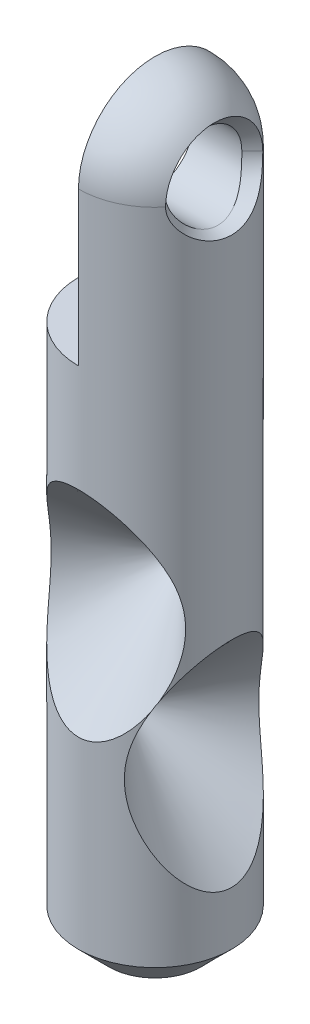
ISO-10303-21;
HEADER;
FILE_DESCRIPTION(('STEP AP214'),'2;1');
FILE_NAME('part.step','',(''),(''),'','','');
FILE_SCHEMA(('AUTOMOTIVE_DESIGN { 1 0 10303 214 1 1 1 1 }'));
ENDSEC;
DATA;
#1=APPLICATION_CONTEXT('core data for automotive mechanical design processes');
#2=APPLICATION_PROTOCOL_DEFINITION('international standard','automotive_design',2000,#1);
#3=PRODUCT_CONTEXT('',#1,'mechanical');
#4=PRODUCT('Part','Part','',(#3));
#5=PRODUCT_RELATED_PRODUCT_CATEGORY('part','',(#4));
#6=PRODUCT_DEFINITION_FORMATION('','',#4);
#7=PRODUCT_DEFINITION_CONTEXT('part definition',#1,'design');
#8=PRODUCT_DEFINITION('design','',#6,#7);
#9=PRODUCT_DEFINITION_SHAPE('','',#8);
#10=(LENGTH_UNIT() NAMED_UNIT(*) SI_UNIT(.MILLI.,.METRE.));
#11=(NAMED_UNIT(*) PLANE_ANGLE_UNIT() SI_UNIT($,.RADIAN.));
#12=(NAMED_UNIT(*) SI_UNIT($,.STERADIAN.) SOLID_ANGLE_UNIT());
#13=UNCERTAINTY_MEASURE_WITH_UNIT(LENGTH_MEASURE(1.E-05),#10,'distance_accuracy_value','');
#14=(GEOMETRIC_REPRESENTATION_CONTEXT(3) GLOBAL_UNCERTAINTY_ASSIGNED_CONTEXT((#13)) GLOBAL_UNIT_ASSIGNED_CONTEXT((#10,
#11,#12)) REPRESENTATION_CONTEXT('',''));
#15=CARTESIAN_POINT('',(0.,0.,0.));
#16=DIRECTION('',(0.,0.,1.));
#17=DIRECTION('',(1.,0.,0.));
#18=AXIS2_PLACEMENT_3D('',#15,#16,#17);
#19=CARTESIAN_POINT('',(-2.00000000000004,12.5,-14.3835569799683));
#20=DIRECTION('',(1.,0.,0.));
#21=DIRECTION('',(0.,0.,-1.));
#22=AXIS2_PLACEMENT_3D('',#19,#20,#21);
#23=PLANE('',#22);
#24=CARTESIAN_POINT('',(-2.,12.5,0.));
#25=DIRECTION('',(-1.,0.,0.));
#26=DIRECTION('',(0.,0.,1.));
#27=AXIS2_PLACEMENT_3D('',#24,#25,#26);
#28=CIRCLE('',#27,0.05);
#29=CARTESIAN_POINT('',(-2.,12.5,0.05));
#30=VERTEX_POINT('',#29);
#31=EDGE_CURVE('E35',#30,#30,#28,.F.);
#32=ORIENTED_EDGE('',*,*,#31,.T.);
#33=EDGE_LOOP('',(#32));
#34=FACE_BOUND('',#33,.T.);
#35=ADVANCED_FACE('F16',(#34),#23,.T.);
#36=CARTESIAN_POINT('',(-14.3835569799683,21.,-2.));
#37=DIRECTION('',(0.,0.,-1.));
#38=DIRECTION('',(-1.,0.,0.));
#39=AXIS2_PLACEMENT_3D('',#36,#37,#38);
#40=PLANE('',#39);
#41=CARTESIAN_POINT('',(0.,21.,-2.));
#42=DIRECTION('',(0.,0.,1.));
#43=DIRECTION('',(1.,0.,0.));
#44=AXIS2_PLACEMENT_3D('',#41,#42,#43);
#45=CIRCLE('',#44,0.0500000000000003);
#46=CARTESIAN_POINT('',(0.0500000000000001,21.,-2.));
#47=VERTEX_POINT('',#46);
#48=EDGE_CURVE('E40',#47,#47,#45,.T.);
#49=ORIENTED_EDGE('',*,*,#48,.T.);
#50=EDGE_LOOP('',(#49));
#51=FACE_BOUND('',#50,.T.);
#52=ADVANCED_FACE('F230',(#51),#40,.F.);
#53=CARTESIAN_POINT('',(1.5,12.5,0.));
#54=DIRECTION('',(-1.,0.,0.));
#55=DIRECTION('',(0.,0.,1.));
#56=AXIS2_PLACEMENT_3D('',#53,#54,#55);
#57=CYLINDRICAL_SURFACE('',#56,0.05);
#58=ORIENTED_EDGE('',*,*,#31,.F.);
#59=EDGE_LOOP('',(#58));
#60=FACE_BOUND('',#59,.T.);
#61=CARTESIAN_POINT('',(-1.95000000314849,12.5,0.));
#62=DIRECTION('',(1.,0.,0.));
#63=DIRECTION('',(0.,0.,1.));
#64=AXIS2_PLACEMENT_3D('',#61,#62,#63);
#65=CIRCLE('',#64,0.050000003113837);
#66=CARTESIAN_POINT('',(-1.95000000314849,12.5,0.050000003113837));
#67=VERTEX_POINT('',#66);
#68=EDGE_CURVE('E112',#67,#67,#65,.T.);
#69=ORIENTED_EDGE('',*,*,#68,.T.);
#70=EDGE_LOOP('',(#69));
#71=FACE_BOUND('',#70,.T.);
#72=ADVANCED_FACE('F147',(#60,#71),#57,.F.);
#73=CARTESIAN_POINT('',(0.,21.,-1.95));
#74=DIRECTION('',(0.,0.,-1.));
#75=DIRECTION('',(-1.,0.,0.));
#76=AXIS2_PLACEMENT_3D('',#73,#74,#75);
#77=CYLINDRICAL_SURFACE('',#76,0.0500000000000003);
#78=ORIENTED_EDGE('',*,*,#48,.F.);
#79=EDGE_LOOP('',(#78));
#80=FACE_BOUND('',#79,.T.);
#81=CARTESIAN_POINT('',(0.,21.,-1.95));
#82=DIRECTION('',(0.,0.,1.));
#83=DIRECTION('',(0.,-1.,0.));
#84=AXIS2_PLACEMENT_3D('',#81,#82,#83);
#85=CIRCLE('',#84,0.0499999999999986);
#86=CARTESIAN_POINT('',(0.,20.95,-1.95));
#87=VERTEX_POINT('',#86);
#88=EDGE_CURVE('E106',#87,#87,#85,.T.);
#89=ORIENTED_EDGE('',*,*,#88,.T.);
#90=EDGE_LOOP('',(#89));
#91=FACE_BOUND('',#90,.T.);
#92=ADVANCED_FACE('F176',(#80,#91),#77,.F.);
#93=CARTESIAN_POINT('',(0.,0.,0.));
#94=DIRECTION('',(0.,-1.,0.));
#95=DIRECTION('',(0.,0.,-1.));
#96=AXIS2_PLACEMENT_3D('',#93,#94,#95);
#97=PLANE('',#96);
#98=CARTESIAN_POINT('',(0.,-9.09494701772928E-10,0.));
#99=DIRECTION('',(0.,1.,0.));
#100=DIRECTION('',(0.,0.,1.));
#101=AXIS2_PLACEMENT_3D('',#98,#99,#100);
#102=CIRCLE('',#101,3.0000000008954);
#103=CARTESIAN_POINT('',(0.,-9.09494701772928E-10,3.0000000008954));
#104=VERTEX_POINT('',#103);
#105=EDGE_CURVE('E105',#104,#104,#102,.T.);
#106=ORIENTED_EDGE('',*,*,#105,.F.);
#107=EDGE_LOOP('',(#106));
#108=FACE_BOUND('',#107,.T.);
#109=ADVANCED_FACE('F169',(#108),#97,.T.);
#110=CARTESIAN_POINT('',(0.,45.,0.));
#111=DIRECTION('',(1.,0.,0.));
#112=DIRECTION('',(0.,0.,-1.));
#113=AXIS2_PLACEMENT_3D('',#110,#111,#112);
#114=CYLINDRICAL_SURFACE('',#113,2.5);
#115=CARTESIAN_POINT('',(3.16975103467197,45.,2.5));
#116=CARTESIAN_POINT('',(3.16977038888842,45.0703136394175,2.50000684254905));
#117=CARTESIAN_POINT('',(3.16981172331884,45.140624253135,2.49703366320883));
#118=CARTESIAN_POINT('',(3.1698800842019,45.2807424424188,2.48517971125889));
#119=CARTESIAN_POINT('',(3.16990711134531,45.3505500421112,2.47629922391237));
#120=CARTESIAN_POINT('',(3.16988860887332,45.4891234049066,2.45269139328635));
#121=CARTESIAN_POINT('',(3.16984313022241,45.5578898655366,2.437968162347));
#122=CARTESIAN_POINT('',(3.16975675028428,45.6939225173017,2.40279270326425));
#123=CARTESIAN_POINT('',(3.16971584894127,45.7611887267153,2.38234054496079));
#124=CARTESIAN_POINT('',(3.16967923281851,45.9600784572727,2.31256503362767));
#125=CARTESIAN_POINT('',(3.16976950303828,46.0888499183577,2.25481290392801));
#126=CARTESIAN_POINT('',(3.16985124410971,46.3348245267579,2.11849273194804));
#127=CARTESIAN_POINT('',(3.16984273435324,46.4520299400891,2.03992877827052));
#128=CARTESIAN_POINT('',(3.16981003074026,46.6166193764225,1.90827131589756));
#129=CARTESIAN_POINT('',(3.16979579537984,46.6696342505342,1.86205946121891));
#130=CARTESIAN_POINT('',(3.16975812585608,46.771597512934,1.76532581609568));
#131=CARTESIAN_POINT('',(3.1697346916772,46.8205458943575,1.71480401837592));
#132=CARTESIAN_POINT('',(3.16971424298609,46.9140178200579,1.6098063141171));
#133=CARTESIAN_POINT('',(3.16971723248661,46.9585406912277,1.55532980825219));
#134=CARTESIAN_POINT('',(3.16977986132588,47.0428329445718,1.44283780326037));
#135=CARTESIAN_POINT('',(3.16983950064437,47.0826023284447,1.38482230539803));
#136=CARTESIAN_POINT('',(3.16995324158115,47.1943342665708,1.20606473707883));
#137=CARTESIAN_POINT('',(3.16994239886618,47.258808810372,1.08051233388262));
#138=CARTESIAN_POINT('',(3.16969711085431,47.3657234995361,0.820461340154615));
#139=CARTESIAN_POINT('',(3.16946267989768,47.4081650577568,0.685963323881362));
#140=CARTESIAN_POINT('',(3.16945032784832,47.4698709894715,0.411654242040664));
#141=CARTESIAN_POINT('',(3.16967241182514,47.4891351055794,0.271843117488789));
#142=CARTESIAN_POINT('',(3.16985907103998,47.5002403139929,0.0613449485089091));
#143=CARTESIAN_POINT('',(3.16989686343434,47.5009731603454,-0.0089835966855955));
#144=CARTESIAN_POINT('',(3.16991398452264,47.4965153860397,-0.14947216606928));
#145=CARTESIAN_POINT('',(3.16989331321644,47.4913247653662,-0.219632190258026));
#146=CARTESIAN_POINT('',(3.16981462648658,47.4750506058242,-0.359259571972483));
#147=CARTESIAN_POINT('',(3.16975661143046,47.4639671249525,-0.428726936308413));
#148=CARTESIAN_POINT('',(3.16970089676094,47.435987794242,-0.566482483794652));
#149=CARTESIAN_POINT('',(3.16970319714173,47.4190919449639,-0.634770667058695));
#150=CARTESIAN_POINT('',(3.1697447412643,47.3796075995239,-0.769680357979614));
#151=CARTESIAN_POINT('',(3.16978398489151,47.3570191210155,-0.836301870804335));
#152=CARTESIAN_POINT('',(3.16983428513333,47.3063102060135,-0.967405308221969));
#153=CARTESIAN_POINT('',(3.16984534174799,47.2781897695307,-1.03188723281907));
#154=CARTESIAN_POINT('',(3.16983822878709,47.2166157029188,-1.15825517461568));
#155=CARTESIAN_POINT('',(3.1698200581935,47.1831618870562,-1.22014110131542));
#156=CARTESIAN_POINT('',(3.16980266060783,47.1111597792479,-1.34087460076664));
#157=CARTESIAN_POINT('',(3.16980343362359,47.0726114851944,-1.39972217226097));
#158=CARTESIAN_POINT('',(3.16980749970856,46.9906958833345,-1.51395818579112));
#159=CARTESIAN_POINT('',(3.16981079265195,46.9473288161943,-1.56934680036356));
#160=CARTESIAN_POINT('',(3.16980132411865,46.8560848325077,-1.67627249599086));
#161=CARTESIAN_POINT('',(3.16978856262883,46.8082079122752,-1.72780957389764));
#162=CARTESIAN_POINT('',(3.16979308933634,46.7082821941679,-1.82666610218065));
#163=CARTESIAN_POINT('',(3.16981037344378,46.6562339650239,-1.87398612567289));
#164=CARTESIAN_POINT('',(3.16981863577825,46.5753265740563,-1.9415411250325));
#165=CARTESIAN_POINT('',(3.16981844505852,46.5478821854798,-1.96349054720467));
#166=CARTESIAN_POINT('',(3.16978879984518,46.4920908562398,-2.0062152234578));
#167=CARTESIAN_POINT('',(3.16975934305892,46.4637438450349,-2.02699038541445));
#168=CARTESIAN_POINT('',(3.16972219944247,46.3774113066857,-2.08750476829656));
#169=CARTESIAN_POINT('',(3.16976575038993,46.3181379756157,-2.12542979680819));
#170=CARTESIAN_POINT('',(3.16978217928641,46.1966187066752,-2.19614385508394));
#171=CARTESIAN_POINT('',(3.16975505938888,46.1343728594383,-2.22893304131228));
#172=CARTESIAN_POINT('',(3.16975485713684,46.0073041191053,-2.28916608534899));
#173=CARTESIAN_POINT('',(3.16978179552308,45.9424802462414,-2.31660788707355));
#174=CARTESIAN_POINT('',(3.16976260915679,45.8436905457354,-2.35359829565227));
#175=CARTESIAN_POINT('',(3.16974626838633,45.8104921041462,-2.36523573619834));
#176=CARTESIAN_POINT('',(3.16973817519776,45.7436223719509,-2.38710349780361));
#177=CARTESIAN_POINT('',(3.16974642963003,45.7099509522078,-2.39733342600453));
#178=CARTESIAN_POINT('',(3.16977236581,45.6422706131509,-2.41634467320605));
#179=CARTESIAN_POINT('',(3.16979002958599,45.6082624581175,-2.42512871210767));
#180=CARTESIAN_POINT('',(3.16978373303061,45.5399056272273,-2.44125701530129));
#181=CARTESIAN_POINT('',(3.16975976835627,45.505556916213,-2.44860112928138));
#182=CARTESIAN_POINT('',(3.16972465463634,45.4021029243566,-2.46844899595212));
#183=CARTESIAN_POINT('',(3.16975023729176,45.3325626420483,-2.47877589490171));
#184=CARTESIAN_POINT('',(3.16975823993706,45.2190624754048,-2.49077132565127));
#185=CARTESIAN_POINT('',(3.16975324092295,45.1752808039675,-2.4942342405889));
#186=CARTESIAN_POINT('',(3.16974568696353,45.0876683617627,-2.49884674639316));
#187=CARTESIAN_POINT('',(3.1697431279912,45.0438377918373,-2.50000015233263));
#188=CARTESIAN_POINT('',(3.16975103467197,45.,-2.5));
#189=B_SPLINE_CURVE_WITH_KNOTS('',3,(#115,#116,#117,#118,#119,#120,#121,#122,#123,#124,#125,
#126,#127,#128,#129,#130,#131,#132,#133,#134,#135,#136,#137,#138,#139,#140,#141,#142,#143,#144,
#145,#146,#147,#148,#149,#150,#151,#152,#153,#154,#155,#156,#157,#158,#159,#160,#161,#162,#163,
#164,#165,#166,#167,#168,#169,#170,#171,#172,#173,#174,#175,#176,#177,#178,#179,#180,#181,#182,
#183,#184,#185,#186,#187,#188),.UNSPECIFIED.,.F.,.F.,(4,2,2,2,2,2,2,2,2,2,2,2,2,2,2,2,2,2,2,2,2,
2,2,2,2,2,2,2,2,2,2,2,2,2,2,2,4),(0.,0.210872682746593,0.421735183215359,0.632449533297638,
0.84316131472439,1.26441408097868,1.68558415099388,1.89636058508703,2.10713737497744,
2.31794617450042,2.52875489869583,2.94997900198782,3.37117609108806,3.7923778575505,
4.00317103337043,4.21396420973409,4.42475531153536,4.63554639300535,4.8463368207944,
5.05712724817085,5.2679250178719,5.47872287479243,5.68951020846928,5.90029771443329,
6.11105652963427,6.21645602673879,6.32186378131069,6.53269370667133,6.74351720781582,
6.95442161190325,7.05993320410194,7.16547418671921,7.27081430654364,7.37616541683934,
7.586783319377,7.71848486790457,7.84996867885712),.UNSPECIFIED.);
#190=CARTESIAN_POINT('',(3.16975103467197,45.,2.5));
#191=VERTEX_POINT('',#190);
#192=CARTESIAN_POINT('',(3.16975103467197,45.,-2.5));
#193=VERTEX_POINT('',#192);
#194=EDGE_CURVE('E19',#191,#193,#189,.T.);
#195=ORIENTED_EDGE('',*,*,#194,.F.);
#196=CARTESIAN_POINT('',(3.16975103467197,45.,-2.5));
#197=CARTESIAN_POINT('',(3.16974905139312,44.9862423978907,-2.50000002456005));
#198=CARTESIAN_POINT('',(3.16983108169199,44.9724848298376,-2.49988643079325));
#199=CARTESIAN_POINT('',(3.17018514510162,44.9449760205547,-2.49943225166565));
#200=CARTESIAN_POINT('',(3.17045717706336,44.9312247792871,-2.49909166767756));
#201=CARTESIAN_POINT('',(3.17159095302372,44.8900001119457,-2.49773014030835));
#202=CARTESIAN_POINT('',(3.17277034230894,44.8625452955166,-2.49636942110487));
#203=CARTESIAN_POINT('',(3.1759060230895,44.8077631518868,-2.49274908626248));
#204=CARTESIAN_POINT('',(3.17786169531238,44.7804357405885,-2.49049018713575));
#205=CARTESIAN_POINT('',(3.18246961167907,44.7259288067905,-2.48508254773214));
#206=CARTESIAN_POINT('',(3.18512187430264,44.6987492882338,-2.48193378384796));
#207=CARTESIAN_POINT('',(3.19412582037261,44.6179163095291,-2.47122438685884));
#208=CARTESIAN_POINT('',(3.20154880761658,44.5645444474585,-2.46237229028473));
#209=CARTESIAN_POINT('',(3.21901152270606,44.4588915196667,-2.44133270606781));
#210=CARTESIAN_POINT('',(3.22905200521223,44.4066107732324,-2.42914425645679));
#211=CARTESIAN_POINT('',(3.24713997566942,44.3229333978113,-2.40679933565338));
#212=CARTESIAN_POINT('',(3.25450342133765,44.2911218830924,-2.39761986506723));
#213=CARTESIAN_POINT('',(3.27006511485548,44.228071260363,-2.37806972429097));
#214=CARTESIAN_POINT('',(3.27826340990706,44.1968321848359,-2.36769898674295));
#215=CARTESIAN_POINT('',(3.29535569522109,44.1349514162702,-2.34579802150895));
#216=CARTESIAN_POINT('',(3.30424980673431,44.1043098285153,-2.33426759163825));
#217=CARTESIAN_POINT('',(3.32264311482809,44.0436614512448,-2.3100826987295));
#218=CARTESIAN_POINT('',(3.33214229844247,44.0136546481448,-2.29742825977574));
#219=CARTESIAN_POINT('',(3.36156986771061,43.9244724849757,-2.25776091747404));
#220=CARTESIAN_POINT('',(3.38238020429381,43.8663082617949,-2.22910542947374));
#221=CARTESIAN_POINT('',(3.42545519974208,43.7528053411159,-2.16764109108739));
#222=CARTESIAN_POINT('',(3.44771979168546,43.6974665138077,-2.13483243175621));
#223=CARTESIAN_POINT('',(3.49367989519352,43.5890550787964,-2.06481467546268));
#224=CARTESIAN_POINT('',(3.51739087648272,43.5360241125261,-2.02755125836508));
#225=CARTESIAN_POINT('',(3.5651797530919,43.4331177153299,-1.94911804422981));
#226=CARTESIAN_POINT('',(3.58925764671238,43.3832422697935,-1.90794826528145));
#227=CARTESIAN_POINT('',(3.63746350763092,43.2868368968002,-1.82188111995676));
#228=CARTESIAN_POINT('',(3.66159147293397,43.2403068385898,-1.77698389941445));
#229=CARTESIAN_POINT('',(3.69727913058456,43.173110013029,-1.70690342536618));
#230=CARTESIAN_POINT('',(3.70909238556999,43.1511415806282,-1.68308440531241));
#231=CARTESIAN_POINT('',(3.73256067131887,43.1081105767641,-1.63456620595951));
#232=CARTESIAN_POINT('',(3.74421569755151,43.0870480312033,-1.60986700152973));
#233=CARTESIAN_POINT('',(3.78240673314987,43.0188027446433,-1.52659913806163));
#234=CARTESIAN_POINT('',(3.8084003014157,42.9736135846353,-1.46611742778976));
#235=CARTESIAN_POINT('',(3.85825023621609,42.8885370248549,-1.34069614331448));
#236=CARTESIAN_POINT('',(3.88210629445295,42.8486503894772,-1.27575592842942));
#237=CARTESIAN_POINT('',(3.92708045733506,42.7746764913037,-1.14183221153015));
#238=CARTESIAN_POINT('',(3.94820127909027,42.7405834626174,-1.07285282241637));
#239=CARTESIAN_POINT('',(3.98706027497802,42.678630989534,-0.9312439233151));
#240=CARTESIAN_POINT('',(4.00479948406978,42.6507696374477,-0.858615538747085));
#241=CARTESIAN_POINT('',(4.0329486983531,42.6067480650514,-0.725403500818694));
#242=CARTESIAN_POINT('',(4.0441156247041,42.5893602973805,-0.665384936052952));
#243=CARTESIAN_POINT('',(4.05887073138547,42.5666364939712,-0.574216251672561));
#244=CARTESIAN_POINT('',(4.06345669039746,42.5596213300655,-0.5436353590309));
#245=CARTESIAN_POINT('',(4.0719275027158,42.5467306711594,-0.482137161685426));
#246=CARTESIAN_POINT('',(4.07581239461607,42.5408551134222,-0.451219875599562));
#247=CARTESIAN_POINT('',(4.08275293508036,42.5302676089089,-0.389118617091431));
#248=CARTESIAN_POINT('',(4.08580921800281,42.5255547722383,-0.357934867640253));
#249=CARTESIAN_POINT('',(4.09108696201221,42.5173058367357,-0.295340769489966));
#250=CARTESIAN_POINT('',(4.09330837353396,42.5137698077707,-0.263930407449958));
#251=CARTESIAN_POINT('',(4.0970872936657,42.5078891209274,-0.200956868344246));
#252=CARTESIAN_POINT('',(4.09864474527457,42.5055445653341,-0.169393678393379));
#253=CARTESIAN_POINT('',(4.10111795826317,42.5020550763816,-0.106176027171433));
#254=CARTESIAN_POINT('',(4.10203373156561,42.5009101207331,-0.0745215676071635));
#255=CARTESIAN_POINT('',(4.10308389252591,42.4998230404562,-0.0111001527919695));
#256=CARTESIAN_POINT('',(4.10321636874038,42.4998838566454,0.0206668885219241));
#257=CARTESIAN_POINT('',(4.10262355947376,42.501215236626,0.0841649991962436));
#258=CARTESIAN_POINT('',(4.10189829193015,42.5024857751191,0.115896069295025));
#259=CARTESIAN_POINT('',(4.09836497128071,42.5081060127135,0.210918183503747));
#260=CARTESIAN_POINT('',(4.09419994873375,42.5142638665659,0.274065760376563));
#261=CARTESIAN_POINT('',(4.08252259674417,42.5313003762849,0.399407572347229));
#262=CARTESIAN_POINT('',(4.0750095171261,42.5421800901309,0.461601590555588));
#263=CARTESIAN_POINT('',(4.0618168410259,42.5619229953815,0.553868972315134));
#264=CARTESIAN_POINT('',(4.05709759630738,42.5690763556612,0.584460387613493));
#265=CARTESIAN_POINT('',(4.04705451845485,42.5845032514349,0.645258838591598));
#266=CARTESIAN_POINT('',(4.04173070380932,42.5927767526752,0.675465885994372));
#267=CARTESIAN_POINT('',(4.02552900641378,42.6180757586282,0.761475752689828));
#268=CARTESIAN_POINT('',(4.01384171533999,42.6364638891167,0.816733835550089));
#269=CARTESIAN_POINT('',(3.98829341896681,42.6768463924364,0.925373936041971));
#270=CARTESIAN_POINT('',(3.97443286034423,42.6988400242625,0.978756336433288));
#271=CARTESIAN_POINT('',(3.94481719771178,42.7462301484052,1.08343043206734));
#272=CARTESIAN_POINT('',(3.92906238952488,42.7716261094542,1.13472245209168));
#273=CARTESIAN_POINT('',(3.89600259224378,42.825636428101,1.23506716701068));
#274=CARTESIAN_POINT('',(3.87869735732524,42.8542512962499,1.2841195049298));
#275=CARTESIAN_POINT('',(3.84050731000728,42.9184634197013,1.38610773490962));
#276=CARTESIAN_POINT('',(3.81945032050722,42.9544844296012,1.43871273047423));
#277=CARTESIAN_POINT('',(3.77603540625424,43.0301429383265,1.54068026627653));
#278=CARTESIAN_POINT('',(3.753677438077,43.069780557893,1.5900426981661));
#279=CARTESIAN_POINT('',(3.70810867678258,43.1525248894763,1.68547617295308));
#280=CARTESIAN_POINT('',(3.68489677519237,43.1956362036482,1.73154269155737));
#281=CARTESIAN_POINT('',(3.63817913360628,43.2851318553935,1.82021835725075));
#282=CARTESIAN_POINT('',(3.61467337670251,43.3315163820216,1.86282730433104));
#283=CARTESIAN_POINT('',(3.56407634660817,43.4349161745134,1.95085062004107));
#284=CARTESIAN_POINT('',(3.53700066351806,43.4924580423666,1.99565761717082));
#285=CARTESIAN_POINT('',(3.48371711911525,43.6115213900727,2.08025514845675));
#286=CARTESIAN_POINT('',(3.45750945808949,43.6730437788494,2.12004453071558));
#287=CARTESIAN_POINT('',(3.40682454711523,43.7998308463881,2.19430795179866));
#288=CARTESIAN_POINT('',(3.38234599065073,43.8650926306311,2.22878602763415));
#289=CARTESIAN_POINT('',(3.3360265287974,43.9991687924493,2.29212325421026));
#290=CARTESIAN_POINT('',(3.31418438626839,44.0679814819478,2.32098504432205));
#291=CARTESIAN_POINT('',(3.27934680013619,44.1907959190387,2.36607309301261));
#292=CARTESIAN_POINT('',(3.26551898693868,44.2440713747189,2.3836416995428));
#293=CARTESIAN_POINT('',(3.24029506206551,44.352210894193,2.41527239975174));
#294=CARTESIAN_POINT('',(3.22889838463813,44.4070745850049,2.429335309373));
#295=CARTESIAN_POINT('',(3.20883994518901,44.517963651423,2.45374335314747));
#296=CARTESIAN_POINT('',(3.20017117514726,44.5739856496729,2.46409802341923));
#297=CARTESIAN_POINT('',(3.18594577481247,44.6869727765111,2.48098211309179));
#298=CARTESIAN_POINT('',(3.18038725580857,44.7439373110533,2.48751385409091));
#299=CARTESIAN_POINT('',(3.1742603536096,44.834185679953,2.49471529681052));
#300=CARTESIAN_POINT('',(3.1725757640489,44.8672973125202,2.49669587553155));
#301=CARTESIAN_POINT('',(3.17032458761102,44.933604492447,2.49933854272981));
#302=CARTESIAN_POINT('',(3.16975778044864,44.9668000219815,2.50000089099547));
#303=CARTESIAN_POINT('',(3.16975103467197,45.,2.5));
#304=B_SPLINE_CURVE_WITH_KNOTS('',3,(#196,#197,#198,#199,#200,#201,#202,#203,#204,#205,#206,
#207,#208,#209,#210,#211,#212,#213,#214,#215,#216,#217,#218,#219,#220,#221,#222,#223,#224,#225,
#226,#227,#228,#229,#230,#231,#232,#233,#234,#235,#236,#237,#238,#239,#240,#241,#242,#243,#244,
#245,#246,#247,#248,#249,#250,#251,#252,#253,#254,#255,#256,#257,#258,#259,#260,#261,#262,#263,
#264,#265,#266,#267,#268,#269,#270,#271,#272,#273,#274,#275,#276,#277,#278,#279,#280,#281,#282,
#283,#284,#285,#286,#287,#288,#289,#290,#291,#292,#293,#294,#295,#296,#297,#298,#299,#300,#301,
#302,#303),.UNSPECIFIED.,.F.,.F.,(4,2,2,2,2,2,2,2,2,2,2,2,2,2,2,2,2,2,2,2,2,2,2,2,2,2,2,2,2,2,2,
2,2,2,2,2,2,2,2,2,2,2,2,2,2,2,2,2,2,2,2,2,2,4),(0.,0.04127182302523,0.082543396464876,
0.165055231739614,0.247501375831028,0.329949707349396,0.493573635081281,0.657244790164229,
0.758967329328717,0.860695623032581,0.962441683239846,1.06418556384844,1.26824053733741,
1.47228612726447,1.67913833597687,1.88598958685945,2.0928327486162,2.19627969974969,
2.29972960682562,2.5389320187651,2.77816887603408,3.01716622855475,3.25609031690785,
3.44627781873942,3.54137884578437,3.63647463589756,3.73149741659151,3.82652583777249,
3.92156241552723,4.01659722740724,4.11186385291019,4.20712848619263,4.39757517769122,
4.58806456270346,4.68334872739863,4.77862997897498,4.95662654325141,5.13458657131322,
5.31251884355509,5.49047937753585,5.69171011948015,5.89294758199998,6.09445618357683,
6.29597643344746,6.52908871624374,6.76225441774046,6.99524201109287,7.22811984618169,
7.40128774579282,7.57441530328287,7.7470943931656,7.91966850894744,8.01926820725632,
8.11884827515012),.UNSPECIFIED.);
#305=EDGE_CURVE('E101',#193,#191,#304,.T.);
#306=ORIENTED_EDGE('',*,*,#305,.F.);
#307=EDGE_LOOP('',(#195,#306));
#308=FACE_BOUND('',#307,.T.);
#309=CARTESIAN_POINT('',(0.,45.,0.));
#310=DIRECTION('',(1.,0.,0.));
#311=DIRECTION('',(0.,0.,-1.));
#312=AXIS2_PLACEMENT_3D('',#309,#310,#311);
#313=CIRCLE('',#312,2.5);
#314=CARTESIAN_POINT('',(0.,45.,-2.5));
#315=VERTEX_POINT('',#314);
#316=EDGE_CURVE('E82',#315,#315,#313,.F.);
#317=ORIENTED_EDGE('',*,*,#316,.T.);
#318=EDGE_LOOP('',(#317));
#319=FACE_BOUND('',#318,.T.);
#320=ADVANCED_FACE('F165',(#308,#319),#114,.F.);
#321=CARTESIAN_POINT('',(3.87025707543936,45.0000000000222,3.1808150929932));
#322=CARTESIAN_POINT('',(3.87025707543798,45.2436396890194,3.1808150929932));
#323=CARTESIAN_POINT('',(3.87025707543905,45.7299847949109,3.12373870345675));
#324=CARTESIAN_POINT('',(3.87025707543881,46.4055460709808,2.88318573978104));
#325=CARTESIAN_POINT('',(3.87025707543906,47.0123343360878,2.49776135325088));
#326=CARTESIAN_POINT('',(3.87025707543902,47.6874770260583,1.81634727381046));
#327=CARTESIAN_POINT('',(3.87025707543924,48.2120151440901,0.713673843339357));
#328=CARTESIAN_POINT('',(3.8702570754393,48.203831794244,-0.507895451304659));
#329=CARTESIAN_POINT('',(3.87025707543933,47.9208857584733,-1.29783581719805));
#330=CARTESIAN_POINT('',(3.87025707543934,47.6875070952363,-1.71385456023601));
#331=CARTESIAN_POINT('',(3.87025707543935,47.4783958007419,-2.00429163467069));
#332=CARTESIAN_POINT('',(3.87025707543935,47.2382559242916,-2.26941186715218));
#333=CARTESIAN_POINT('',(3.87025707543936,46.969078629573,-2.50660310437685));
#334=CARTESIAN_POINT('',(3.87025707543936,46.6649390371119,-2.71943418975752));
#335=CARTESIAN_POINT('',(3.87025707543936,46.3695206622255,-2.87663522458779));
#336=CARTESIAN_POINT('',(3.87025707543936,46.1165814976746,-2.98067041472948));
#337=CARTESIAN_POINT('',(3.87025707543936,45.8607869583,-3.06737297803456));
#338=CARTESIAN_POINT('',(3.87025707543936,45.6059265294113,-3.12672427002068));
#339=CARTESIAN_POINT('',(3.87025707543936,45.3768720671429,-3.1597164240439));
#340=CARTESIAN_POINT('',(3.87025707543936,45.2348847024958,-3.17296915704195));
#341=CARTESIAN_POINT('',(3.87025707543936,45.1171069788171,-3.17931866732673));
#342=CARTESIAN_POINT('',(3.87025707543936,45.0399891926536,-3.1808150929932));
#343=CARTESIAN_POINT('',(3.87025707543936,45.,-3.1808150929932));
#344=CARTESIAN_POINT('',(3.86794517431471,45.0000000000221,3.17856817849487));
#345=CARTESIAN_POINT('',(3.86794517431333,45.2434675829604,3.17856817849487));
#346=CARTESIAN_POINT('',(3.8679451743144,45.7294691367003,3.12153210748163));
#347=CARTESIAN_POINT('',(3.86794517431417,46.4045531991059,2.8811490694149));
#348=CARTESIAN_POINT('',(3.86794517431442,47.0109128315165,2.49599694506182));
#349=CARTESIAN_POINT('',(3.86794517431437,47.6855786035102,1.81506421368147));
#350=CARTESIAN_POINT('',(3.86794517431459,48.2097461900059,0.713169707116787));
#351=CARTESIAN_POINT('',(3.86794517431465,48.201568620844,-0.507536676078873));
#352=CARTESIAN_POINT('',(3.86794517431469,47.9188224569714,-1.29691903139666));
#353=CARTESIAN_POINT('',(3.86794517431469,47.6856086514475,-1.71264390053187));
#354=CARTESIAN_POINT('',(3.8679451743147,47.4766450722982,-2.00287581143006));
#355=CARTESIAN_POINT('',(3.86794517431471,47.2366748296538,-2.26780876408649));
#356=CARTESIAN_POINT('',(3.86794517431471,46.9676876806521,-2.50483245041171));
#357=CARTESIAN_POINT('',(3.86794517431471,46.663762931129,-2.71751319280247));
#358=CARTESIAN_POINT('',(3.86794517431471,46.368553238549,-2.87460318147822));
#359=CARTESIAN_POINT('',(3.86794517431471,46.1157927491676,-2.97856488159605));
#360=CARTESIAN_POINT('',(3.86794517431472,45.8601789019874,-3.0652061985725));
#361=CARTESIAN_POINT('',(3.86794517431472,45.6054985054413,-3.12451556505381));
#362=CARTESIAN_POINT('',(3.86794517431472,45.3766058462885,-3.15748441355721));
#363=CARTESIAN_POINT('',(3.86794517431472,45.2347187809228,-3.17072778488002));
#364=CARTESIAN_POINT('',(3.86794517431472,45.1170242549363,-3.17707280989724));
#365=CARTESIAN_POINT('',(3.86794517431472,45.0399609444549,-3.17856817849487));
#366=CARTESIAN_POINT('',(3.86794517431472,45.,-3.17856817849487));
#367=CARTESIAN_POINT('',(3.86563327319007,45.000000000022,3.17632126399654));
#368=CARTESIAN_POINT('',(3.86563327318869,45.2432954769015,3.17632126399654));
#369=CARTESIAN_POINT('',(3.86563327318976,45.7289534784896,3.11932551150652));
#370=CARTESIAN_POINT('',(3.86563327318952,46.4035603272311,2.87911239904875));
#371=CARTESIAN_POINT('',(3.86563327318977,47.0094913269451,2.49423253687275));
#372=CARTESIAN_POINT('',(3.86563327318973,47.6836801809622,1.81378115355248));
#373=CARTESIAN_POINT('',(3.86563327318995,48.2074772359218,0.712665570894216));
#374=CARTESIAN_POINT('',(3.86563327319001,48.1993054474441,-0.507177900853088));
#375=CARTESIAN_POINT('',(3.86563327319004,47.9167591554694,-1.29600224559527));
#376=CARTESIAN_POINT('',(3.86563327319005,47.6837102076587,-1.71143324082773));
#377=CARTESIAN_POINT('',(3.86563327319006,47.4748943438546,-2.00145998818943));
#378=CARTESIAN_POINT('',(3.86563327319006,47.235093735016,-2.2662056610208));
#379=CARTESIAN_POINT('',(3.86563327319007,46.9662967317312,-2.50306179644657));
#380=CARTESIAN_POINT('',(3.86563327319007,46.6625868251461,-2.71559219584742));
#381=CARTESIAN_POINT('',(3.86563327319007,46.3675858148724,-2.87257113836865));
#382=CARTESIAN_POINT('',(3.86563327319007,46.1150040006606,-2.97645934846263));
#383=CARTESIAN_POINT('',(3.86563327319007,45.8595708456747,-3.06303941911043));
#384=CARTESIAN_POINT('',(3.86563327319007,45.6050704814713,-3.12230686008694));
#385=CARTESIAN_POINT('',(3.86563327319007,45.3763396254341,-3.15525240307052));
#386=CARTESIAN_POINT('',(3.86563327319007,45.2345528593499,-3.16848641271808));
#387=CARTESIAN_POINT('',(3.86563327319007,45.1169415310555,-3.17482695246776));
#388=CARTESIAN_POINT('',(3.86563327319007,45.0399326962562,-3.17632126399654));
#389=CARTESIAN_POINT('',(3.86563327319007,45.,-3.17632126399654));
#390=CARTESIAN_POINT('',(3.86332137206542,45.0000000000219,3.17407434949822));
#391=CARTESIAN_POINT('',(3.86332137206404,45.2431233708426,3.17407434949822));
#392=CARTESIAN_POINT('',(3.86332137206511,45.7284378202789,3.1171189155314));
#393=CARTESIAN_POINT('',(3.86332137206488,46.4025674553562,2.87707572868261));
#394=CARTESIAN_POINT('',(3.86332137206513,47.0080698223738,2.49246812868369));
#395=CARTESIAN_POINT('',(3.86332137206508,47.6817817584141,1.81249809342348));
#396=CARTESIAN_POINT('',(3.8633213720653,48.2052082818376,0.712161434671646));
#397=CARTESIAN_POINT('',(3.86332137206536,48.1970422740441,-0.506819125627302));
#398=CARTESIAN_POINT('',(3.8633213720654,47.9146958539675,-1.29508545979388));
#399=CARTESIAN_POINT('',(3.86332137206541,47.6818117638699,-1.71022258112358));
#400=CARTESIAN_POINT('',(3.86332137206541,47.4731436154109,-2.00004416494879));
#401=CARTESIAN_POINT('',(3.86332137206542,47.2335126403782,-2.2646025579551));
#402=CARTESIAN_POINT('',(3.86332137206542,46.9649057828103,-2.50129114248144));
#403=CARTESIAN_POINT('',(3.86332137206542,46.6614107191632,-2.71367119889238));
#404=CARTESIAN_POINT('',(3.86332137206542,46.3666183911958,-2.87053909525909));
#405=CARTESIAN_POINT('',(3.86332137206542,46.1142152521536,-2.97435381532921));
#406=CARTESIAN_POINT('',(3.86332137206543,45.8589627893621,-3.06087263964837));
#407=CARTESIAN_POINT('',(3.86332137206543,45.6046424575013,-3.12009815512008));
#408=CARTESIAN_POINT('',(3.86332137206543,45.3760734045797,-3.15302039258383));
#409=CARTESIAN_POINT('',(3.86332137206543,45.2343869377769,-3.16624504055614));
#410=CARTESIAN_POINT('',(3.86332137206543,45.1168588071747,-3.17258109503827));
#411=CARTESIAN_POINT('',(3.86332137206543,45.0399044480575,-3.17407434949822));
#412=CARTESIAN_POINT('',(3.86332137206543,45.,-3.17407434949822));
#413=CARTESIAN_POINT('',(3.63213125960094,45.0000000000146,2.94938289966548));
#414=CARTESIAN_POINT('',(3.63213125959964,45.2259127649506,2.94938289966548));
#415=CARTESIAN_POINT('',(3.63213125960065,45.6768719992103,2.89645931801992));
#416=CARTESIAN_POINT('',(3.63213125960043,46.3032802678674,2.67340869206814));
#417=CARTESIAN_POINT('',(3.63213125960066,46.8659193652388,2.31602730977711));
#418=CARTESIAN_POINT('',(3.63213125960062,47.4919395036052,1.68419208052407));
#419=CARTESIAN_POINT('',(3.63213125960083,47.9783128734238,0.661747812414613));
#420=CARTESIAN_POINT('',(3.63213125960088,47.9707249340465,-0.470941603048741));
#421=CARTESIAN_POINT('',(3.63213125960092,47.7083657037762,-1.20340687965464));
#422=CARTESIAN_POINT('',(3.63213125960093,47.4919673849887,-1.58915661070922));
#423=CARTESIAN_POINT('',(3.63213125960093,47.2980707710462,-1.85846184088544));
#424=CARTESIAN_POINT('',(3.63213125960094,47.0754031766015,-2.10429225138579));
#425=CARTESIAN_POINT('',(3.63213125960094,46.8258108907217,-2.32422574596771));
#426=CARTESIAN_POINT('',(3.63213125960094,46.5438001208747,-2.52157150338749));
#427=CARTESIAN_POINT('',(3.63213125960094,46.26987602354,-2.66733478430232));
#428=CARTESIAN_POINT('',(3.63213125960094,46.035340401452,-2.76380050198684));
#429=CARTESIAN_POINT('',(3.63213125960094,45.7981571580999,-2.84419469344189));
#430=CARTESIAN_POINT('',(3.63213125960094,45.5618400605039,-2.89922765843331));
#431=CARTESIAN_POINT('',(3.63213125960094,45.3494513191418,-2.92981934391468));
#432=CARTESIAN_POINT('',(3.63213125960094,45.2177947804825,-2.94210782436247));
#433=CARTESIAN_POINT('',(3.63213125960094,45.108586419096,-2.94799535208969));
#434=CARTESIAN_POINT('',(3.63213125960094,45.0370796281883,-2.94938289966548));
#435=CARTESIAN_POINT('',(3.63213125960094,45.,-2.94938289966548));
#436=CARTESIAN_POINT('',(3.40094114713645,45.0000000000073,2.72469144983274));
#437=CARTESIAN_POINT('',(3.40094114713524,45.2087021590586,2.72469144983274));
#438=CARTESIAN_POINT('',(3.40094114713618,45.6253061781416,2.67579972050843));
#439=CARTESIAN_POINT('',(3.40094114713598,46.2039930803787,2.46974165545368));
#440=CARTESIAN_POINT('',(3.4009411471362,46.7237689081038,2.13958649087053));
#441=CARTESIAN_POINT('',(3.40094114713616,47.3020972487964,1.55588606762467));
#442=CARTESIAN_POINT('',(3.40094114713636,47.7514174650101,0.611334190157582));
#443=CARTESIAN_POINT('',(3.40094114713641,47.7444075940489,-0.435064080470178));
#444=CARTESIAN_POINT('',(3.40094114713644,47.5020355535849,-1.11172829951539));
#445=CARTESIAN_POINT('',(3.40094114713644,47.3021230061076,-1.46809064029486));
#446=CARTESIAN_POINT('',(3.40094114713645,47.1229979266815,-1.71687951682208));
#447=CARTESIAN_POINT('',(3.40094114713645,46.9172937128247,-1.94398194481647));
#448=CARTESIAN_POINT('',(3.40094114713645,46.6867159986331,-2.14716034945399));
#449=CARTESIAN_POINT('',(3.40094114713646,46.4261895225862,-2.32947180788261));
#450=CARTESIAN_POINT('',(3.40094114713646,46.1731336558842,-2.46413047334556));
#451=CARTESIAN_POINT('',(3.40094114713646,45.9564655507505,-2.55324718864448));
#452=CARTESIAN_POINT('',(3.40094114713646,45.7373515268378,-2.6275167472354));
#453=CARTESIAN_POINT('',(3.40094114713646,45.5190376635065,-2.67835716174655));
#454=CARTESIAN_POINT('',(3.40094114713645,45.3228292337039,-2.70661829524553));
#455=CARTESIAN_POINT('',(3.40094114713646,45.2012026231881,-2.71797060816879));
#456=CARTESIAN_POINT('',(3.40094114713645,45.1003140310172,-2.72340960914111));
#457=CARTESIAN_POINT('',(3.40094114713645,45.0342548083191,-2.72469144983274));
#458=CARTESIAN_POINT('',(3.40094114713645,45.,-2.72469144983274));
#459=CARTESIAN_POINT('',(3.16975103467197,45.,2.5));
#460=CARTESIAN_POINT('',(3.16975103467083,45.1914915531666,2.5));
#461=CARTESIAN_POINT('',(3.16975103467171,45.573740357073,2.45514012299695));
#462=CARTESIAN_POINT('',(3.16975103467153,46.10470589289,2.26607461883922));
#463=CARTESIAN_POINT('',(3.16975103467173,46.5816184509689,1.96314567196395));
#464=CARTESIAN_POINT('',(3.1697510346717,47.1122549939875,1.42758005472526));
#465=CARTESIAN_POINT('',(3.16975103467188,47.5245220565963,0.56092056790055));
#466=CARTESIAN_POINT('',(3.16975103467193,47.5180902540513,-0.399186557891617));
#467=CARTESIAN_POINT('',(3.16975103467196,47.2957054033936,-1.02004971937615));
#468=CARTESIAN_POINT('',(3.16975103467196,47.1122786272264,-1.34702466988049));
#469=CARTESIAN_POINT('',(3.16975103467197,46.9479250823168,-1.57529719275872));
#470=CARTESIAN_POINT('',(3.16975103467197,46.7591842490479,-1.78367163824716));
#471=CARTESIAN_POINT('',(3.16975103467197,46.5476211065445,-1.97009495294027));
#472=CARTESIAN_POINT('',(3.16975103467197,46.3085789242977,-2.13737211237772));
#473=CARTESIAN_POINT('',(3.16975103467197,46.0763912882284,-2.2609261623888));
#474=CARTESIAN_POINT('',(3.16975103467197,45.8775907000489,-2.34269387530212));
#475=CARTESIAN_POINT('',(3.16975103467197,45.6765458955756,-2.41083880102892));
#476=CARTESIAN_POINT('',(3.16975103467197,45.4762352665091,-2.45748666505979));
#477=CARTESIAN_POINT('',(3.16975103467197,45.296207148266,-2.48341724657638));
#478=CARTESIAN_POINT('',(3.16975103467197,45.1846104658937,-2.49383339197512));
#479=CARTESIAN_POINT('',(3.16975103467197,45.0920416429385,-2.49882386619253));
#480=CARTESIAN_POINT('',(3.16975103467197,45.0314299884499,-2.5));
#481=CARTESIAN_POINT('',(3.16975103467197,45.,-2.5));
#482=CARTESIAN_POINT('',(3.16741601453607,44.9999999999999,2.49773061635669));
#483=CARTESIAN_POINT('',(3.16741601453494,45.1913177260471,2.49773061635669));
#484=CARTESIAN_POINT('',(3.16741601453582,45.5732195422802,2.45291146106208));
#485=CARTESIAN_POINT('',(3.16741601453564,46.1037030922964,2.26401758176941));
#486=CARTESIAN_POINT('',(3.16741601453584,46.5801827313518,1.96136361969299));
#487=CARTESIAN_POINT('',(3.1674160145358,47.110337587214,1.42628416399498));
#488=CARTESIAN_POINT('',(3.16741601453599,47.5222304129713,0.560411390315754));
#489=CARTESIAN_POINT('',(3.16741601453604,47.5158044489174,-0.398824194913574));
#490=CARTESIAN_POINT('',(3.16741601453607,47.2936214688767,-1.01912376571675));
#491=CARTESIAN_POINT('',(3.16741601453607,47.1103611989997,-1.34580190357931));
#492=CARTESIAN_POINT('',(3.16741601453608,46.9461568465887,-1.57386721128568));
#493=CARTESIAN_POINT('',(3.16741601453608,46.7575873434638,-1.78205250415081));
#494=CARTESIAN_POINT('',(3.16741601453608,46.5462162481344,-1.96830659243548));
#495=CARTESIAN_POINT('',(3.16741601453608,46.307391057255,-2.13543190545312));
#496=CARTESIAN_POINT('',(3.16741601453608,46.075414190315,-2.25887379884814));
#497=CARTESIAN_POINT('',(3.16741601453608,45.8767940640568,-2.34056728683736));
#498=CARTESIAN_POINT('',(3.16741601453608,45.6759317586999,-2.40865035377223));
#499=CARTESIAN_POINT('',(3.16741601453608,45.4758029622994,-2.45525587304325));
#500=CARTESIAN_POINT('',(3.16741601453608,45.295938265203,-2.48116291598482));
#501=CARTESIAN_POINT('',(3.16741601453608,45.1844428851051,-2.49156960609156));
#502=CARTESIAN_POINT('',(3.16741601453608,45.0919580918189,-2.49655555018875));
#503=CARTESIAN_POINT('',(3.16741601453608,45.0314014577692,-2.49773061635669));
#504=CARTESIAN_POINT('',(3.16741601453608,45.,-2.49773061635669));
#505=CARTESIAN_POINT('',(3.16508099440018,44.9999999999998,2.49546123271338));
#506=CARTESIAN_POINT('',(3.16508099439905,45.1911438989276,2.49546123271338));
#507=CARTESIAN_POINT('',(3.16508099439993,45.5726987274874,2.45068279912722));
#508=CARTESIAN_POINT('',(3.16508099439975,46.1027002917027,2.26196054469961));
#509=CARTESIAN_POINT('',(3.16508099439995,46.5787470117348,1.95958156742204));
#510=CARTESIAN_POINT('',(3.16508099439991,47.1084201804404,1.42498827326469));
#511=CARTESIAN_POINT('',(3.1650809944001,47.5199387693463,0.559902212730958));
#512=CARTESIAN_POINT('',(3.16508099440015,47.5135186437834,-0.39846183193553));
#513=CARTESIAN_POINT('',(3.16508099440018,47.2915375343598,-1.01819781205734));
#514=CARTESIAN_POINT('',(3.16508099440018,47.108443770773,-1.34457913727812));
#515=CARTESIAN_POINT('',(3.16508099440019,46.9443886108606,-1.57243722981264));
#516=CARTESIAN_POINT('',(3.16508099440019,46.7559904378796,-1.78043337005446));
#517=CARTESIAN_POINT('',(3.16508099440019,46.5448113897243,-1.96651823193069));
#518=CARTESIAN_POINT('',(3.16508099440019,46.3062031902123,-2.13349169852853));
#519=CARTESIAN_POINT('',(3.16508099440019,46.0744370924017,-2.25682143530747));
#520=CARTESIAN_POINT('',(3.16508099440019,45.8759974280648,-2.3384406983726));
#521=CARTESIAN_POINT('',(3.16508099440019,45.6753176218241,-2.40646190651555));
#522=CARTESIAN_POINT('',(3.16508099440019,45.4753706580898,-2.45302508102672));
#523=CARTESIAN_POINT('',(3.16508099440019,45.2956693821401,-2.47890858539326));
#524=CARTESIAN_POINT('',(3.16508099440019,45.1842753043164,-2.48930582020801));
#525=CARTESIAN_POINT('',(3.16508099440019,45.0918745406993,-2.49428723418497));
#526=CARTESIAN_POINT('',(3.16508099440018,45.0313729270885,-2.49546123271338));
#527=CARTESIAN_POINT('',(3.16508099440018,45.,-2.49546123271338));
#528=CARTESIAN_POINT('',(3.16274597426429,44.9999999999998,2.49319184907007));
#529=CARTESIAN_POINT('',(3.16274597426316,45.1909700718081,2.49319184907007));
#530=CARTESIAN_POINT('',(3.16274597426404,45.5721779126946,2.44845413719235));
#531=CARTESIAN_POINT('',(3.16274597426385,46.1016974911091,2.2599035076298));
#532=CARTESIAN_POINT('',(3.16274597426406,46.5773112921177,1.95779951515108));
#533=CARTESIAN_POINT('',(3.16274597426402,47.1065027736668,1.42369238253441));
#534=CARTESIAN_POINT('',(3.16274597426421,47.5176471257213,0.559393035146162));
#535=CARTESIAN_POINT('',(3.16274597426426,47.5112328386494,-0.398099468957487));
#536=CARTESIAN_POINT('',(3.16274597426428,47.2894535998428,-1.01727185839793));
#537=CARTESIAN_POINT('',(3.16274597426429,47.1065263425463,-1.34335637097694));
#538=CARTESIAN_POINT('',(3.1627459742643,46.9426203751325,-1.5710072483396));
#539=CARTESIAN_POINT('',(3.1627459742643,46.7543935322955,-1.77881423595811));
#540=CARTESIAN_POINT('',(3.1627459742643,46.5434065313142,-1.9647298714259));
#541=CARTESIAN_POINT('',(3.1627459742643,46.3050153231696,-2.13155149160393));
#542=CARTESIAN_POINT('',(3.1627459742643,46.0734599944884,-2.25476907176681));
#543=CARTESIAN_POINT('',(3.1627459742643,45.8752007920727,-2.33631410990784));
#544=CARTESIAN_POINT('',(3.1627459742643,45.6747034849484,-2.40427345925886));
#545=CARTESIAN_POINT('',(3.1627459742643,45.4749383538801,-2.45079428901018));
#546=CARTESIAN_POINT('',(3.1627459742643,45.2954004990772,-2.4766542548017));
#547=CARTESIAN_POINT('',(3.1627459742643,45.1841077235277,-2.48704203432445));
#548=CARTESIAN_POINT('',(3.16274597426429,45.0917909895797,-2.49201891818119));
#549=CARTESIAN_POINT('',(3.16274597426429,45.0313443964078,-2.49319184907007));
#550=CARTESIAN_POINT('',(3.16274597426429,45.,-2.49319184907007));
#551=B_SPLINE_SURFACE_WITH_KNOTS('',3,3,((#321,#322,#323,#324,#325,#326,#327,#328,#329,#330,
#331,#332,#333,#334,#335,#336,#337,#338,#339,#340,#341,#342,#343),(#344,#345,#346,#347,#348,
#349,#350,#351,#352,#353,#354,#355,#356,#357,#358,#359,#360,#361,#362,#363,#364,#365,#366),
(#367,#368,#369,#370,#371,#372,#373,#374,#375,#376,#377,#378,#379,#380,#381,#382,#383,#384,#385,
#386,#387,#388,#389),(#390,#391,#392,#393,#394,#395,#396,#397,#398,#399,#400,#401,#402,#403,
#404,#405,#406,#407,#408,#409,#410,#411,#412),(#413,#414,#415,#416,#417,#418,#419,#420,#421,
#422,#423,#424,#425,#426,#427,#428,#429,#430,#431,#432,#433,#434,#435),(#436,#437,#438,#439,
#440,#441,#442,#443,#444,#445,#446,#447,#448,#449,#450,#451,#452,#453,#454,#455,#456,#457,#458),
(#459,#460,#461,#462,#463,#464,#465,#466,#467,#468,#469,#470,#471,#472,#473,#474,#475,#476,#477,
#478,#479,#480,#481),(#482,#483,#484,#485,#486,#487,#488,#489,#490,#491,#492,#493,#494,#495,
#496,#497,#498,#499,#500,#501,#502,#503,#504),(#505,#506,#507,#508,#509,#510,#511,#512,#513,
#514,#515,#516,#517,#518,#519,#520,#521,#522,#523,#524,#525,#526,#527),(#528,#529,#530,#531,
#532,#533,#534,#535,#536,#537,#538,#539,#540,#541,#542,#543,#544,#545,#546,#547,#548,#549,
#550)),.UNSPECIFIED.,.F.,.F.,.F.,(4,3,3,4),(4,1,1,1,1,1,1,1,1,1,1,1,1,1,1,1,1,1,1,1,4),(-0.01,
0.,1.,1.0101),(0.839693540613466,0.89803242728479,0.956371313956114,1.01471020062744,
1.07304908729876,1.18972686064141,1.30640463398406,1.36474352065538,1.39391296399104,
1.4230824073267,1.45225185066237,1.48142129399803,1.51059073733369,1.53976018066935,
1.55434490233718,1.56892962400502,1.59809906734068,1.61268378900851,1.62726851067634,
1.64185323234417,1.656437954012),.UNSPECIFIED.);
#552=DIRECTION('',(0.71711383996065,2.26640472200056E-11,0.696956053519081));
#553=VECTOR('',#552,1.);
#554=CARTESIAN_POINT('',(3.5165362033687,45.000000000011,2.83703717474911));
#555=LINE('',#554,#553);
#556=CARTESIAN_POINT('',(3.86332137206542,45.000000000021,3.17407434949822));
#557=VERTEX_POINT('',#556);
#558=EDGE_CURVE('E83',#191,#557,#555,.T.);
#559=DIRECTION('',(-0.717113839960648,0.,0.696956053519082));
#560=VECTOR('',#559,1.);
#561=CARTESIAN_POINT('',(3.5165362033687,45.,-2.83703717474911));
#562=LINE('',#561,#560);
#563=CARTESIAN_POINT('',(3.86332137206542,45.,-3.17407434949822));
#564=VERTEX_POINT('',#563);
#565=EDGE_CURVE('E102',#564,#193,#562,.T.);
#566=CARTESIAN_POINT('',(3.86332137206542,45.0000000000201,3.17407434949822));
#567=CARTESIAN_POINT('',(3.86332973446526,45.0833666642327,3.17406045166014));
#568=CARTESIAN_POINT('',(3.8633511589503,45.1666821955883,3.17075105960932));
#569=CARTESIAN_POINT('',(3.86338948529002,45.332794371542,3.15759802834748));
#570=CARTESIAN_POINT('',(3.86340638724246,45.415591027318,3.14775453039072));
#571=CARTESIAN_POINT('',(3.86340434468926,45.6624358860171,3.10853117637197));
#572=CARTESIAN_POINT('',(3.86333277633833,45.8250896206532,3.06945822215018));
#573=CARTESIAN_POINT('',(3.86328851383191,46.0684307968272,2.9902293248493));
#574=CARTESIAN_POINT('',(3.86328535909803,46.152150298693,2.95897817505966));
#575=CARTESIAN_POINT('',(3.86330397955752,46.3166589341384,2.88950865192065));
#576=CARTESIAN_POINT('',(3.86332575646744,46.3974478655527,2.85128979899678));
#577=CARTESIAN_POINT('',(3.86337210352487,46.6344910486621,2.72664844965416));
#578=CARTESIAN_POINT('',(3.86337777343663,46.7855978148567,2.63018346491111));
#579=CARTESIAN_POINT('',(3.86335793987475,47.0693225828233,2.41334149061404));
#580=CARTESIAN_POINT('',(3.86333246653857,47.2019583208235,2.29298771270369));
#581=CARTESIAN_POINT('',(3.86330371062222,47.3842763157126,2.09716421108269));
#582=CARTESIAN_POINT('',(3.86329569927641,47.442302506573,2.02930119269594));
#583=CARTESIAN_POINT('',(3.8633187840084,47.5524020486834,1.88890694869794));
#584=CARTESIAN_POINT('',(3.8633498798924,47.6044754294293,1.81637574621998));
#585=CARTESIAN_POINT('',(3.86342224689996,47.7511028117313,1.59282195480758));
#586=CARTESIAN_POINT('',(3.86344282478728,47.8363333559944,1.43554877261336));
#587=CARTESIAN_POINT('',(3.8633274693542,47.9793614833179,1.10899722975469));
#588=CARTESIAN_POINT('',(3.86319155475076,48.0371623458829,0.939720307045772));
#589=CARTESIAN_POINT('',(3.86315065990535,48.1018528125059,0.680141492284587));
#590=CARTESIAN_POINT('',(3.86316440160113,48.1197627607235,0.59247275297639));
#591=CARTESIAN_POINT('',(3.86322862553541,48.1480877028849,0.415942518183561));
#592=CARTESIAN_POINT('',(3.86327910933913,48.1585023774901,0.327080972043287));
#593=CARTESIAN_POINT('',(3.86339532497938,48.1784412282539,0.0596186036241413));
#594=CARTESIAN_POINT('',(3.86342596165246,48.1766958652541,-0.120004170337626));
#595=CARTESIAN_POINT('',(3.86337854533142,48.1516145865,-0.386841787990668));
#596=CARTESIAN_POINT('',(3.86334722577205,48.139524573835,-0.475301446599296));
#597=CARTESIAN_POINT('',(3.86330388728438,48.1079146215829,-0.650916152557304));
#598=CARTESIAN_POINT('',(3.86329186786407,48.0883948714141,-0.738071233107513));
#599=CARTESIAN_POINT('',(3.86330265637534,48.0420442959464,-0.910398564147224));
#600=CARTESIAN_POINT('',(3.86332546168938,48.015214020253,-0.995570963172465));
#601=CARTESIAN_POINT('',(3.86335938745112,47.9544888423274,-1.1633614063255));
#602=CARTESIAN_POINT('',(3.86337050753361,47.9205937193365,-1.24597937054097));
#603=CARTESIAN_POINT('',(3.8633739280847,47.8460055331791,-1.4080276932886));
#604=CARTESIAN_POINT('',(3.86336624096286,47.8053169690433,-1.48746011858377));
#605=CARTESIAN_POINT('',(3.86335578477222,47.7174090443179,-1.64259804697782));
#606=CARTESIAN_POINT('',(3.86335301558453,47.6701898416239,-1.71830364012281));
#607=CARTESIAN_POINT('',(3.86334483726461,47.5192286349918,-1.93901157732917));
#608=CARTESIAN_POINT('',(3.86333955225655,47.406116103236,-2.0777501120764));
#609=CARTESIAN_POINT('',(3.86335176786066,47.1580252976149,-2.33437573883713));
#610=CARTESIAN_POINT('',(3.8633692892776,47.0230271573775,-2.45224368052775));
#611=CARTESIAN_POINT('',(3.86332654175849,46.8433742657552,-2.58431478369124));
#612=CARTESIAN_POINT('',(3.86331474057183,46.8068566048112,-2.60999308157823));
#613=CARTESIAN_POINT('',(3.86330920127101,46.7327612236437,-2.65976859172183));
#614=CARTESIAN_POINT('',(3.86331545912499,46.6951837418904,-2.68386615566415));
#615=CARTESIAN_POINT('',(3.8633301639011,46.6190455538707,-2.73045112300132));
#616=CARTESIAN_POINT('',(3.8633386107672,46.5804848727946,-2.75293856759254));
#617=CARTESIAN_POINT('',(3.86334215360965,46.5024562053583,-2.79628468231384));
#618=CARTESIAN_POINT('',(3.86333724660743,46.4629880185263,-2.81714298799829));
#619=CARTESIAN_POINT('',(3.86331632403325,46.2635381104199,-2.91720405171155));
#620=CARTESIAN_POINT('',(3.86331110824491,46.0969914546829,-2.98385214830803));
#621=CARTESIAN_POINT('',(3.86331842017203,45.7553068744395,-3.08806575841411));
#622=CARTESIAN_POINT('',(3.86333092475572,45.5801804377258,-3.12566908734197));
#623=CARTESIAN_POINT('',(3.86332720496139,45.3363990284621,-3.15691461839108));
#624=CARTESIAN_POINT('',(3.86332400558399,45.2692167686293,-3.16335391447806));
#625=CARTESIAN_POINT('',(3.86331961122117,45.1346985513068,-3.17193067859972));
#626=CARTESIAN_POINT('',(3.86331841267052,45.0673630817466,-3.17407579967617));
#627=CARTESIAN_POINT('',(3.86332137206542,45.,-3.17407434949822));
#628=B_SPLINE_CURVE_WITH_KNOTS('',3,(#566,#567,#568,#569,#570,#571,#572,#573,#574,#575,#576,
#577,#578,#579,#580,#581,#582,#583,#584,#585,#586,#587,#588,#589,#590,#591,#592,#593,#594,#595,
#596,#597,#598,#599,#600,#601,#602,#603,#604,#605,#606,#607,#608,#609,#610,#611,#612,#613,#614,
#615,#616,#617,#618,#619,#620,#621,#622,#623,#624,#625,#626,#627),.UNSPECIFIED.,.F.,.F.,(4,2,2,
2,2,2,2,2,2,2,2,2,2,2,2,2,2,2,2,2,2,2,2,2,2,2,2,2,2,2,4),(0.,0.249935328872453,
0.499865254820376,0.999277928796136,1.26709641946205,1.53493335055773,2.07005835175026,
2.60466591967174,2.87225124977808,3.13983525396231,3.67383035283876,4.20776159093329,
4.47590613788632,4.74406210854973,5.2799337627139,5.54754155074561,5.81514251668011,
6.08272336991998,6.35031258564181,6.61772528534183,6.88513152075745,7.41947091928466,
7.95429810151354,8.08820442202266,8.22208084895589,8.35595384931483,8.48985671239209,
9.02519392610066,9.55983296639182,9.76219386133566,9.9641937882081),.UNSPECIFIED.);
#629=EDGE_CURVE('E211',#557,#564,#628,.T.);
#630=ORIENTED_EDGE('',*,*,#558,.F.);
#631=ORIENTED_EDGE('',*,*,#194,.T.);
#632=ORIENTED_EDGE('',*,*,#565,.F.);
#633=ORIENTED_EDGE('',*,*,#629,.F.);
#634=EDGE_LOOP('',(#630,#631,#632,#633));
#635=FACE_BOUND('',#634,.T.);
#636=ADVANCED_FACE('F168',(#635),#551,.T.);
#637=CARTESIAN_POINT('',(5.04170000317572,12.5,0.));
#638=DIRECTION('',(1.,0.,0.));
#639=DIRECTION('',(0.,0.,-1.));
#640=AXIS2_PLACEMENT_3D('',#637,#638,#639);
#641=CONICAL_SURFACE('',#640,7.04169999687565,0.785398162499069);
#642=CARTESIAN_POINT('',(3.65808419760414,17.0161373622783,3.40858036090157));
#643=CARTESIAN_POINT('',(3.63161772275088,16.9719023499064,3.42325717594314));
#644=CARTESIAN_POINT('',(3.60639667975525,16.9274742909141,3.43960643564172));
#645=CARTESIAN_POINT('',(3.5588434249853,16.838696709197,3.47536518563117));
#646=CARTESIAN_POINT('',(3.53649456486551,16.7943483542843,3.49475544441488));
#647=CARTESIAN_POINT('',(3.494755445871,16.7056516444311,3.53649456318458));
#648=CARTESIAN_POINT('',(3.4753651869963,16.6613032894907,3.55884342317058));
#649=CARTESIAN_POINT('',(3.43960643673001,16.5725257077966,3.60639667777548));
#650=CARTESIAN_POINT('',(3.42325717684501,16.5280976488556,3.63161772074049));
#651=CARTESIAN_POINT('',(3.40858036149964,16.4838626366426,3.65808419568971));
#652=B_SPLINE_CURVE_WITH_KNOTS('',3,(#642,#643,#644,#645,#646,#647,#648,#649,#650,#651),
.UNSPECIFIED.,.F.,.F.,(4,2,2,2,4),(0.,0.16075370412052,0.320528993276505,0.480304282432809,
0.641057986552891),.UNSPECIFIED.);
#653=CARTESIAN_POINT('',(3.65808419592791,17.0161373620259,3.40858035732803));
#654=VERTEX_POINT('',#653);
#655=CARTESIAN_POINT('',(3.40858035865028,16.4838626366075,3.65808419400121));
#656=VERTEX_POINT('',#655);
#657=EDGE_CURVE('E109',#654,#656,#652,.T.);
#658=ORIENTED_EDGE('',*,*,#657,.T.);
#659=CARTESIAN_POINT('',(3.65808419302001,17.0161373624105,3.40858035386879));
#660=CARTESIAN_POINT('',(3.69516219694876,17.0926214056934,3.3687855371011));
#661=CARTESIAN_POINT('',(3.73235071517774,17.1683092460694,3.32757597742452));
#662=CARTESIAN_POINT('',(3.80677456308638,17.3179872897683,3.24217211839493));
#663=CARTESIAN_POINT('',(3.8440099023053,17.3919770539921,3.19797705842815));
#664=CARTESIAN_POINT('',(3.95585113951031,17.6118812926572,3.06027504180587));
#665=CARTESIAN_POINT('',(4.03023439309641,17.7549973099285,2.96202864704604));
#666=CARTESIAN_POINT('',(4.17783850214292,18.0343264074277,2.75002388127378));
#667=CARTESIAN_POINT('',(4.25102072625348,18.1703891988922,2.63603903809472));
#668=CARTESIAN_POINT('',(4.39261705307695,18.4302163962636,2.39263137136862));
#669=CARTESIAN_POINT('',(4.46104175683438,18.5540084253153,2.26324473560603));
#670=CARTESIAN_POINT('',(4.58554537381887,18.7770176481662,1.99813939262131));
#671=CARTESIAN_POINT('',(4.64216804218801,18.8773895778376,1.86365870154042));
#672=CARTESIAN_POINT('',(4.74614614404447,19.06043866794,1.58011210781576));
#673=CARTESIAN_POINT('',(4.79352773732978,19.1431658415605,1.43108922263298));
#674=CARTESIAN_POINT('',(4.85548423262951,19.2508395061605,1.19623449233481));
#675=CARTESIAN_POINT('',(4.87472529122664,19.2841796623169,1.11541806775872));
#676=CARTESIAN_POINT('',(4.90951602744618,19.3443450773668,0.950646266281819));
#677=CARTESIAN_POINT('',(4.92506784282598,19.3711741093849,0.866692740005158));
#678=CARTESIAN_POINT('',(4.9520162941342,19.4175986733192,0.696384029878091));
#679=CARTESIAN_POINT('',(4.96342328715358,19.4372122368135,0.610035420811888));
#680=CARTESIAN_POINT('',(4.98176717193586,19.4687271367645,0.435520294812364));
#681=CARTESIAN_POINT('',(4.98870789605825,19.4806350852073,0.347355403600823));
#682=CARTESIAN_POINT('',(4.99552815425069,19.4923328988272,0.215767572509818));
#683=CARTESIAN_POINT('',(4.99720334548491,19.4952052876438,0.172687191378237));
#684=CARTESIAN_POINT('',(4.99943959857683,19.4990393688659,0.0864070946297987));
#685=CARTESIAN_POINT('',(5.00000052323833,19.5000008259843,0.0432073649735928));
#686=CARTESIAN_POINT('',(4.99999896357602,19.4999983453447,-0.0855846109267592));
#687=CARTESIAN_POINT('',(4.99779507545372,19.4962211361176,-0.171199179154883));
#688=CARTESIAN_POINT('',(4.98904851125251,19.4812191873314,-0.341592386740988));
#689=CARTESIAN_POINT('',(4.98250252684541,19.4699887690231,-0.426370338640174));
#690=CARTESIAN_POINT('',(4.96525748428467,19.4403648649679,-0.594448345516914));
#691=CARTESIAN_POINT('',(4.95454834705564,19.4219539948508,-0.677744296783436));
#692=CARTESIAN_POINT('',(4.92929622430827,19.3784635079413,-0.841997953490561));
#693=CARTESIAN_POINT('',(4.91475106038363,19.353380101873,-0.922954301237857));
#694=CARTESIAN_POINT('',(4.86630704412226,19.2696487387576,-1.15961951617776));
#695=CARTESIAN_POINT('',(4.82736709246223,19.2021232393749,-1.3112368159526));
#696=CARTESIAN_POINT('',(4.73921059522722,19.0482140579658,-1.60090867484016));
#697=CARTESIAN_POINT('',(4.68999335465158,18.9618291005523,-1.73896231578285));
#698=CARTESIAN_POINT('',(4.55254061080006,18.7184808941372,-2.0797673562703));
#699=CARTESIAN_POINT('',(4.45852384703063,18.5501232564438,-2.27208617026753));
#700=CARTESIAN_POINT('',(4.31001864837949,18.2789183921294,-2.53653226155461));
#701=CARTESIAN_POINT('',(4.25917462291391,18.1852248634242,-2.62080196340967));
#702=CARTESIAN_POINT('',(4.15575919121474,17.9925071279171,-2.7818722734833));
#703=CARTESIAN_POINT('',(4.10318816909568,17.893484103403,-2.85867452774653));
#704=CARTESIAN_POINT('',(3.96468683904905,17.629155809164,-3.05000216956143));
#705=CARTESIAN_POINT('',(3.87796091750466,17.4602504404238,-3.15897533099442));
#706=CARTESIAN_POINT('',(3.7044937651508,17.1129870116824,-3.36071645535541));
#707=CARTESIAN_POINT('',(3.61775255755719,16.9346232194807,-3.45347444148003));
#708=CARTESIAN_POINT('',(3.44638577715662,16.5693292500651,-3.62451606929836));
#709=CARTESIAN_POINT('',(3.36176773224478,16.3823738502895,-3.70275317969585));
#710=CARTESIAN_POINT('',(3.19739867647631,16.0013013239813,-3.84558014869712));
#711=CARTESIAN_POINT('',(3.11764698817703,15.8071852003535,-3.91017190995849));
#712=CARTESIAN_POINT('',(2.96152852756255,15.4013764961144,-4.0298313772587));
#713=CARTESIAN_POINT('',(2.88559041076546,15.1893047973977,-4.0841781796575));
#714=CARTESIAN_POINT('',(2.74584301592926,14.7581745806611,-4.17941411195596));
#715=CARTESIAN_POINT('',(2.68203506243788,14.539115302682,-4.22030177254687));
#716=CARTESIAN_POINT('',(2.57109586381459,14.0962414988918,-4.28878839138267));
#717=CARTESIAN_POINT('',(2.52385933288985,13.8724669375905,-4.31647166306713));
#718=CARTESIAN_POINT('',(2.44956400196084,13.4204059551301,-4.35907214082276));
#719=CARTESIAN_POINT('',(2.42249547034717,13.1921217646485,-4.3739955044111));
#720=CARTESIAN_POINT('',(2.39278555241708,12.7547440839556,-4.3903112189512));
#721=CARTESIAN_POINT('',(2.38811401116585,12.5458313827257,-4.39282874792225));
#722=CARTESIAN_POINT('',(2.39812164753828,12.1286094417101,-4.38737331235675));
#723=CARTESIAN_POINT('',(2.41280127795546,11.9203002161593,-4.37940010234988));
#724=CARTESIAN_POINT('',(2.46026350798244,11.5055204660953,-4.35290998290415));
#725=CARTESIAN_POINT('',(2.49312822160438,11.2990626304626,-4.33434523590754));
#726=CARTESIAN_POINT('',(2.57435421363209,10.8904897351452,-4.28659565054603));
#727=CARTESIAN_POINT('',(2.6227192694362,10.6883757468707,-4.25740822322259));
#728=CARTESIAN_POINT('',(2.74047163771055,10.2577335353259,-4.18275085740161));
#729=CARTESIAN_POINT('',(2.81197807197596,10.030110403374,-4.13543075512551));
#730=CARTESIAN_POINT('',(2.96690759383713,9.58267098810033,-4.02572605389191));
#731=CARTESIAN_POINT('',(3.05033462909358,9.36285732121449,-3.96333645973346));
#732=CARTESIAN_POINT('',(3.22498999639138,8.9317720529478,-3.82256752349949));
#733=CARTESIAN_POINT('',(3.31621335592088,8.72049513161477,-3.74419832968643));
#734=CARTESIAN_POINT('',(3.50293849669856,8.30737349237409,-3.57011421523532));
#735=CARTESIAN_POINT('',(3.59843781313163,8.10552347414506,-3.4744091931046));
#736=CARTESIAN_POINT('',(3.81380165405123,7.66508487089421,-3.23825936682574));
#737=CARTESIAN_POINT('',(3.9339930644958,7.42936156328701,-3.09259081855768));
#738=CARTESIAN_POINT('',(4.11045571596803,7.0926770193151,-2.84853954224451));
#739=CARTESIAN_POINT('',(4.16860657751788,6.9833240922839,-2.76298803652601));
#740=CARTESIAN_POINT('',(4.28267406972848,6.77129756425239,-2.58265087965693));
#741=CARTESIAN_POINT('',(4.33859147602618,6.6686216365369,-2.48786847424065));
#742=CARTESIAN_POINT('',(4.46857022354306,6.43221509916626,-2.24879198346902));
#743=CARTESIAN_POINT('',(4.54104093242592,6.30230130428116,-2.09976140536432));
#744=CARTESIAN_POINT('',(4.67526252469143,6.06397690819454,-1.78092808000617));
#745=CARTESIAN_POINT('',(4.73702721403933,5.95553858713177,-1.61115257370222));
#746=CARTESIAN_POINT('',(4.83175357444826,5.79027164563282,-1.29408702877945));
#747=CARTESIAN_POINT('',(4.86807207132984,5.72730232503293,-1.1510305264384));
#748=CARTESIAN_POINT('',(4.92864939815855,5.62259604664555,-0.855022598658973));
#749=CARTESIAN_POINT('',(4.95293626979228,5.58080971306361,-0.702095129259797));
#750=CARTESIAN_POINT('',(4.97993642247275,5.53441576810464,-0.45652866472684));
#751=CARTESIAN_POINT('',(4.98743182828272,5.52155456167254,-0.365902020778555));
#752=CARTESIAN_POINT('',(4.99746383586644,5.5043462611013,-0.183514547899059));
#753=CARTESIAN_POINT('',(4.99999909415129,5.50000147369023,-0.0917534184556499));
#754=CARTESIAN_POINT('',(5.00000084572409,5.49999863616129,0.0856633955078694));
#755=CARTESIAN_POINT('',(4.99779260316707,5.50378315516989,0.171320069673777));
#756=CARTESIAN_POINT('',(4.98903461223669,5.51880460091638,0.341790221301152));
#757=CARTESIAN_POINT('',(4.98248283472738,5.53004501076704,0.426603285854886));
#758=CARTESIAN_POINT('',(4.96523061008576,5.55968134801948,0.594669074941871));
#759=CARTESIAN_POINT('',(4.95452378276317,5.57808827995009,0.677919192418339));
#760=CARTESIAN_POINT('',(4.92928073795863,5.6215631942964,0.842083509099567));
#761=CARTESIAN_POINT('',(4.91474240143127,5.64663486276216,0.922996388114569));
#762=CARTESIAN_POINT('',(4.86631128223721,5.73034393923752,1.15959923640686));
#763=CARTESIAN_POINT('',(4.82737729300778,5.79785907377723,1.31119724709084));
#764=CARTESIAN_POINT('',(4.73922348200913,5.95176332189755,1.6008724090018));
#765=CARTESIAN_POINT('',(4.6900002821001,6.03815863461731,1.73894509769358));
#766=CARTESIAN_POINT('',(4.5525369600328,6.28152556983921,2.07977647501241));
#767=CARTESIAN_POINT('',(4.45851574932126,6.44989124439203,2.27210276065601));
#768=CARTESIAN_POINT('',(4.31000776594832,6.72110162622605,2.53655055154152));
#769=CARTESIAN_POINT('',(4.25916579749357,6.81479149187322,2.62081614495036));
#770=CARTESIAN_POINT('',(4.15575466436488,7.00750139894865,2.78187888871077));
#771=CARTESIAN_POINT('',(4.10318588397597,7.10652025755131,2.85867768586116));
#772=CARTESIAN_POINT('',(3.9646942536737,7.3708300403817,3.04999192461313));
#773=CARTESIAN_POINT('',(3.87797597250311,7.53972024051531,3.1589564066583));
#774=CARTESIAN_POINT('',(3.70452390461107,7.88695183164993,3.3606828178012));
#775=CARTESIAN_POINT('',(3.6177901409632,8.06529895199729,3.45343477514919));
#776=CARTESIAN_POINT('',(3.44642255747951,8.4305900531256,3.62448151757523));
#777=CARTESIAN_POINT('',(3.36179667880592,8.61756064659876,3.70272720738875));
#778=CARTESIAN_POINT('',(3.19741253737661,8.99866493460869,3.84556892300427));
#779=CARTESIAN_POINT('',(3.11765359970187,9.19279762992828,3.91016684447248));
#780=CARTESIAN_POINT('',(2.96149704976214,9.598705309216,4.02985550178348));
#781=CARTESIAN_POINT('',(2.88553074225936,9.81086175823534,4.08422087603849));
#782=CARTESIAN_POINT('',(2.74573800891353,10.2421669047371,4.17948363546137));
#783=CARTESIAN_POINT('',(2.68191291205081,10.4613163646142,4.22037954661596));
#784=CARTESIAN_POINT('',(2.57099906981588,10.9042005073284,4.288845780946));
#785=CARTESIAN_POINT('',(2.52379229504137,11.127890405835,4.31651060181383));
#786=CARTESIAN_POINT('',(2.44954234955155,11.5797762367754,4.35908404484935));
#787=CARTESIAN_POINT('',(2.42248931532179,11.8079699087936,4.37399890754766));
#788=CARTESIAN_POINT('',(2.39280523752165,12.2449651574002,4.3903003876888));
#789=CARTESIAN_POINT('',(2.38812682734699,12.4535844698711,4.39282173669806));
#790=CARTESIAN_POINT('',(2.39806711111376,12.8702307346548,4.38740306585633));
#791=CARTESIAN_POINT('',(2.41268675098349,13.0782576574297,4.3794625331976));
#792=CARTESIAN_POINT('',(2.4600509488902,13.4930634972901,4.35303006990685));
#793=CARTESIAN_POINT('',(2.49292823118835,13.6998219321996,4.33446084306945));
#794=CARTESIAN_POINT('',(2.5742263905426,14.1089765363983,4.28667272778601));
#795=CARTESIAN_POINT('',(2.62264953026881,14.311372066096,4.25745228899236));
#796=CARTESIAN_POINT('',(2.72492577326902,14.6854098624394,4.19260737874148));
#797=CARTESIAN_POINT('',(2.77730367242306,14.8576880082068,4.15827108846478));
#798=CARTESIAN_POINT('',(2.88945778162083,15.1978497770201,4.08113511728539));
#799=CARTESIAN_POINT('',(2.94923316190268,15.3657338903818,4.03833638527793));
#800=CARTESIAN_POINT('',(3.07354208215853,15.6947815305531,3.94453147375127));
#801=CARTESIAN_POINT('',(3.1380056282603,15.8560033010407,3.89363631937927));
#802=CARTESIAN_POINT('',(3.2707853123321,16.1736147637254,3.78278203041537));
#803=CARTESIAN_POINT('',(3.33910035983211,16.3300058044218,3.72282545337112));
#804=CARTESIAN_POINT('',(3.40858035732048,16.4838626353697,3.65808419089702));
#805=B_SPLINE_CURVE_WITH_KNOTS('',3,(#659,#660,#661,#662,#663,#664,#665,#666,#667,#668,#669,
#670,#671,#672,#673,#674,#675,#676,#677,#678,#679,#680,#681,#682,#683,#684,#685,#686,#687,#688,
#689,#690,#691,#692,#693,#694,#695,#696,#697,#698,#699,#700,#701,#702,#703,#704,#705,#706,#707,
#708,#709,#710,#711,#712,#713,#714,#715,#716,#717,#718,#719,#720,#721,#722,#723,#724,#725,#726,
#727,#728,#729,#730,#731,#732,#733,#734,#735,#736,#737,#738,#739,#740,#741,#742,#743,#744,#745,
#746,#747,#748,#749,#750,#751,#752,#753,#754,#755,#756,#757,#758,#759,#760,#761,#762,#763,#764,
#765,#766,#767,#768,#769,#770,#771,#772,#773,#774,#775,#776,#777,#778,#779,#780,#781,#782,#783,
#784,#785,#786,#787,#788,#789,#790,#791,#792,#793,#794,#795,#796,#797,#798,#799,#800,#801,#802,
#803,#804),.UNSPECIFIED.,.F.,.F.,(4,2,2,2,2,2,2,2,2,2,2,2,2,2,2,2,2,2,2,2,2,2,2,2,2,2,2,2,2,2,2,
2,2,2,2,2,2,2,2,2,2,2,2,2,2,2,2,2,2,2,2,2,2,2,2,2,2,2,2,2,2,2,2,2,2,2,2,2,2,2,2,2,4),(0.,
0.281527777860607,0.56312755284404,1.12901758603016,1.70411921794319,2.27789532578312,
2.80785645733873,3.33629486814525,3.60453694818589,3.87262321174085,4.14003489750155,
4.40721681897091,4.53679349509,4.66638612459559,4.92308159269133,5.1799728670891,
5.43748999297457,5.69515367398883,6.2040894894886,6.71305973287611,7.5251395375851,
7.93260883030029,8.33998810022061,8.99576110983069,9.6519361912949,10.3101789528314,
10.9683298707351,11.6627459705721,12.3572378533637,13.047233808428,13.7368966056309,
14.3626857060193,14.9884894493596,15.6171423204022,16.2459485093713,16.9746569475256,
17.7036072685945,18.4320960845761,19.1601702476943,20.0636576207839,20.5148783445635,
20.965940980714,21.5957431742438,22.2247270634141,22.7043550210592,23.1828598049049,
23.4579147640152,23.7330442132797,23.989912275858,24.2469004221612,24.5042847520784,
24.7618117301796,25.2706811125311,25.7797178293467,26.5918325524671,26.999284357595,
27.4066460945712,28.0623622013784,28.718480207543,29.3767797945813,30.0349878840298,
30.7296765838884,31.4244412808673,32.1141669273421,32.8035547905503,33.4284701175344,
34.0534160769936,34.6829657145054,35.3126070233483,35.8621212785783,36.4115739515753,
36.95405522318,37.496383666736),.UNSPECIFIED.);
#806=EDGE_CURVE('E130',#654,#656,#805,.T.);
#807=ORIENTED_EDGE('',*,*,#806,.F.);
#808=EDGE_LOOP('',(#658,#807));
#809=FACE_BOUND('',#808,.T.);
#810=ORIENTED_EDGE('',*,*,#68,.F.);
#811=EDGE_LOOP('',(#810));
#812=FACE_BOUND('',#811,.T.);
#813=ADVANCED_FACE('F171',(#809,#812),#641,.F.);
#814=CARTESIAN_POINT('',(0.,21.,5.));
#815=DIRECTION('',(0.,0.,1.));
#816=DIRECTION('',(1.,0.,0.));
#817=AXIS2_PLACEMENT_3D('',#814,#815,#816);
#818=CONICAL_SURFACE('',#817,7.00000000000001,0.785398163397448);
#819=ORIENTED_EDGE('',*,*,#88,.F.);
#820=EDGE_LOOP('',(#819));
#821=FACE_BOUND('',#820,.T.);
#822=CARTESIAN_POINT('',(3.40858035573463,16.4838626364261,3.65808419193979));
#823=CARTESIAN_POINT('',(3.36878553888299,16.4073785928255,3.69516219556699));
#824=CARTESIAN_POINT('',(3.32757597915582,16.3316907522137,3.73235071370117));
#825=CARTESIAN_POINT('',(3.24217212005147,16.1820127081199,3.8067745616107));
#826=CARTESIAN_POINT('',(3.19797706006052,16.1080229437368,3.84400990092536));
#827=CARTESIAN_POINT('',(3.06027504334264,15.8881187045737,3.95585113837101));
#828=CARTESIAN_POINT('',(2.96202864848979,15.7450026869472,4.03023439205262));
#829=CARTESIAN_POINT('',(2.75002388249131,15.4656735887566,4.17783850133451));
#830=CARTESIAN_POINT('',(2.63603903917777,15.3296107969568,4.25102072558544));
#831=CARTESIAN_POINT('',(2.3926313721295,15.0697835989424,4.39261705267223));
#832=CARTESIAN_POINT('',(2.2632447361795,14.9459915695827,4.4610417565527));
#833=CARTESIAN_POINT('',(1.99813939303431,14.7229823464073,4.58554537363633));
#834=CARTESIAN_POINT('',(1.86365870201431,14.6226104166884,4.64216804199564));
#835=CARTESIAN_POINT('',(1.5801121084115,14.4395613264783,4.74614614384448));
#836=CARTESIAN_POINT('',(1.43108922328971,14.3568341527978,4.79352773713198));
#837=CARTESIAN_POINT('',(1.19623449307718,14.2491604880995,4.85548423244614));
#838=CARTESIAN_POINT('',(1.11541806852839,14.2158203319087,4.87472529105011));
#839=CARTESIAN_POINT('',(0.950646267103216,14.1556549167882,4.90951602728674));
#840=CARTESIAN_POINT('',(0.866692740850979,14.1288258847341,4.92506784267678));
#841=CARTESIAN_POINT('',(0.696384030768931,14.0824013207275,4.95201629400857));
#842=CARTESIAN_POINT('',(0.610035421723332,14.0627877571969,4.96342328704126));
#843=CARTESIAN_POINT('',(0.435520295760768,14.0312728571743,4.98176717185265));
#844=CARTESIAN_POINT('',(0.347355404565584,14.0193649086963,4.98870789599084));
#845=CARTESIAN_POINT('',(0.215767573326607,14.0076670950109,4.99552815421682));
#846=CARTESIAN_POINT('',(0.172687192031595,14.0047947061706,4.99720334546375));
#847=CARTESIAN_POINT('',(0.0864070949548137,14.0009606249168,4.99943959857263));
#848=CARTESIAN_POINT('',(0.0432073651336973,13.9999991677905,5.00000052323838));
#849=CARTESIAN_POINT('',(-0.0855846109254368,14.0000016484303,4.99999896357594));
#850=CARTESIAN_POINT('',(-0.171199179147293,14.0037788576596,4.99779507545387));
#851=CARTESIAN_POINT('',(-0.341592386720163,14.0187808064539,4.98904851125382));
#852=CARTESIAN_POINT('',(-0.426370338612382,14.0300112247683,4.98250252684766));
#853=CARTESIAN_POINT('',(-0.594448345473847,14.0596351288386,4.96525748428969));
#854=CARTESIAN_POINT('',(-0.677744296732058,14.0780459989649,4.95454834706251));
#855=CARTESIAN_POINT('',(-0.841997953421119,14.1215364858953,4.92929622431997));
#856=CARTESIAN_POINT('',(-0.922954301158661,14.1466198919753,4.91475106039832));
#857=CARTESIAN_POINT('',(-1.15961951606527,14.2303512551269,4.86630704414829));
#858=CARTESIAN_POINT('',(-1.31123681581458,14.297876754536,4.82736709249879));
#859=CARTESIAN_POINT('',(-1.60090867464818,14.4517859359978,4.73921059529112));
#860=CARTESIAN_POINT('',(-1.7389623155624,14.5381708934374,4.68999335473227));
#861=CARTESIAN_POINT('',(-2.07976735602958,14.7815190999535,4.55254061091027));
#862=CARTESIAN_POINT('',(-2.27208617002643,14.9498767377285,4.45852384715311));
#863=CARTESIAN_POINT('',(-2.53653226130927,15.2210816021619,4.31001864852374));
#864=CARTESIAN_POINT('',(-2.6208019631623,15.3147751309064,4.25917462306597));
#865=CARTESIAN_POINT('',(-2.78187227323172,15.5074928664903,4.15575919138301));
#866=CARTESIAN_POINT('',(-2.85867452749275,15.6065158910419,4.10318816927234));
#867=CARTESIAN_POINT('',(-3.05000216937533,15.870844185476,3.96468683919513));
#868=CARTESIAN_POINT('',(-3.1589753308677,16.0397495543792,3.87796091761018));
#869=CARTESIAN_POINT('',(-3.36071645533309,16.3870129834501,3.70449376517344));
#870=CARTESIAN_POINT('',(-3.45347444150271,16.5653767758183,3.6177525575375));
#871=CARTESIAN_POINT('',(-3.62451606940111,16.9306707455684,3.44638577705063));
#872=CARTESIAN_POINT('',(-3.7027531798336,17.1176261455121,3.36176773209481));
#873=CARTESIAN_POINT('',(-3.84558014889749,17.4986986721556,3.19739867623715));
#874=CARTESIAN_POINT('',(-3.91017191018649,17.6928147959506,3.11764698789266));
#875=CARTESIAN_POINT('',(-4.02983137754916,18.0986235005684,2.96152852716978));
#876=CARTESIAN_POINT('',(-4.08417817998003,18.3106951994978,2.88559041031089));
#877=CARTESIAN_POINT('',(-4.17941411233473,18.7418254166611,2.74584301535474));
#878=CARTESIAN_POINT('',(-4.22030177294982,18.9608846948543,2.68203506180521));
#879=CARTESIAN_POINT('',(-4.28878839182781,19.4037584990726,2.5710958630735));
#880=CARTESIAN_POINT('',(-4.31647166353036,19.627533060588,2.52385933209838));
#881=CARTESIAN_POINT('',(-4.3590721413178,20.0795940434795,2.44956400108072));
#882=CARTESIAN_POINT('',(-4.37399550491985,20.3078782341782,2.42249546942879));
#883=CARTESIAN_POINT('',(-4.39031121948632,20.7452559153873,2.3927855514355));
#884=CARTESIAN_POINT('',(-4.39282874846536,20.954168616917,2.38811401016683));
#885=CARTESIAN_POINT('',(-4.38737331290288,21.371390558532,2.39812164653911));
#886=CARTESIAN_POINT('',(-4.37940010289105,21.5796997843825,2.41280127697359));
#887=CARTESIAN_POINT('',(-4.35290998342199,21.9944795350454,2.4602635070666));
#888=CARTESIAN_POINT('',(-4.33434523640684,22.2009373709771,2.4931282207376));
#889=CARTESIAN_POINT('',(-4.28659565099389,22.6095102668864,2.57435421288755));
#890=CARTESIAN_POINT('',(-4.25740822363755,22.8116242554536,2.62271926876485));
#891=CARTESIAN_POINT('',(-4.18275085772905,23.2422664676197,2.74047163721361));
#892=CARTESIAN_POINT('',(-4.13543075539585,23.4698895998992,2.81197807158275));
#893=CARTESIAN_POINT('',(-4.02572605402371,23.9173290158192,2.96690759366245));
#894=CARTESIAN_POINT('',(-3.96333645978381,24.1371426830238,3.05033462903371));
#895=CARTESIAN_POINT('',(-3.82256752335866,24.5682279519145,3.22498999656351));
#896=CARTESIAN_POINT('',(-3.74419832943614,24.779504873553,3.31621335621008));
#897=CARTESIAN_POINT('',(-3.57011421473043,25.1926265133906,3.50293849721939));
#898=CARTESIAN_POINT('',(-3.47440919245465,25.3944765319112,3.59843781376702));
#899=CARTESIAN_POINT('',(-3.23825936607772,25.834915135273,3.81380165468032));
#900=CARTESIAN_POINT('',(-3.09259081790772,26.0706384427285,3.93399306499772));
#901=CARTESIAN_POINT('',(-2.8485395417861,26.4073229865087,4.11045571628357));
#902=CARTESIAN_POINT('',(-2.76298803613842,26.5166759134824,4.16860657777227));
#903=CARTESIAN_POINT('',(-2.5826508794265,26.7287024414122,4.282674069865));
#904=CARTESIAN_POINT('',(-2.48786847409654,26.8313783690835,4.33859147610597));
#905=CARTESIAN_POINT('',(-2.24879198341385,27.0677849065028,4.46857022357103));
#906=CARTESIAN_POINT('',(-2.09976140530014,27.1976987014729,4.54104093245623));
#907=CARTESIAN_POINT('',(-1.78092807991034,27.4360230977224,4.6752625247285));
#908=CARTESIAN_POINT('',(-1.61115257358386,27.5444614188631,4.73702721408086));
#909=CARTESIAN_POINT('',(-1.29408702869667,27.7097283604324,4.83175357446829));
#910=CARTESIAN_POINT('',(-1.15103052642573,27.7726976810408,4.8680720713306));
#911=CARTESIAN_POINT('',(-0.85502259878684,27.8774039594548,4.9286493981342));
#912=CARTESIAN_POINT('',(-0.702095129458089,27.9191902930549,4.95293626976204));
#913=CARTESIAN_POINT('',(-0.456528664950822,27.9655842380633,4.979936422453));
#914=CARTESIAN_POINT('',(-0.365902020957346,27.978445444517,4.98743182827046));
#915=CARTESIAN_POINT('',(-0.183514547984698,27.995653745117,4.99746383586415));
#916=CARTESIAN_POINT('',(-0.0917534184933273,27.9999985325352,4.99999909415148));
#917=CARTESIAN_POINT('',(0.0856633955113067,28.0000013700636,5.00000084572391));
#918=CARTESIAN_POINT('',(0.171320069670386,27.9962168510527,4.99779260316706));
#919=CARTESIAN_POINT('',(0.341790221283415,27.9811954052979,4.98903461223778));
#920=CARTESIAN_POINT('',(0.426603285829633,27.9699549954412,4.9824828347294));
#921=CARTESIAN_POINT('',(0.594669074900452,27.9403186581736,4.96523061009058));
#922=CARTESIAN_POINT('',(0.677919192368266,27.9219117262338,4.95452378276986));
#923=CARTESIAN_POINT('',(0.842083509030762,27.8784368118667,4.92928073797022));
#924=CARTESIAN_POINT('',(0.922996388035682,27.8533651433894,4.91474240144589));
#925=CARTESIAN_POINT('',(1.15959923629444,27.7696560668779,4.86631128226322));
#926=CARTESIAN_POINT('',(1.31119724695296,27.7021409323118,4.8273772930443));
#927=CARTESIAN_POINT('',(1.60087240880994,27.5482366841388,4.73922348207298));
#928=CARTESIAN_POINT('',(1.73894509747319,27.4618413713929,4.69000028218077));
#929=CARTESIAN_POINT('',(2.07977647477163,27.2184744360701,4.55253696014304));
#930=CARTESIAN_POINT('',(2.27210276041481,27.0501087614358,4.4585157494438));
#931=CARTESIAN_POINT('',(2.53655055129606,26.7788983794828,4.31000776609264));
#932=CARTESIAN_POINT('',(2.6208161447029,26.6852085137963,4.25916579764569));
#933=CARTESIAN_POINT('',(2.78187888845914,26.4924986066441,4.15575466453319));
#934=CARTESIAN_POINT('',(2.85867768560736,26.3934797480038,4.10318588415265));
#935=CARTESIAN_POINT('',(3.0499919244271,26.1291699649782,3.96469425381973));
#936=CARTESIAN_POINT('',(3.1589564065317,25.9602797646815,3.87797597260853));
#937=CARTESIAN_POINT('',(3.3606828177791,25.6130481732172,3.70452390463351));
#938=CARTESIAN_POINT('',(3.45343477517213,25.4347010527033,3.61779014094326));
#939=CARTESIAN_POINT('',(3.62448151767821,25.0694099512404,3.44642255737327));
#940=CARTESIAN_POINT('',(3.70272720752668,24.8824393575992,3.36179667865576));
#941=CARTESIAN_POINT('',(3.84556892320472,24.5013350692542,3.19741253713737));
#942=CARTESIAN_POINT('',(3.91016684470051,24.3072023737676,3.11765359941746));
#943=CARTESIAN_POINT('',(4.02985550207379,23.9012946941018,2.96149704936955));
#944=CARTESIAN_POINT('',(4.08422087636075,23.6891382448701,2.88553074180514));
#945=CARTESIAN_POINT('',(4.17948363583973,23.2578330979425,2.74573800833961));
#946=CARTESIAN_POINT('',(4.22037954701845,23.038683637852,2.68191291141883));
#947=CARTESIAN_POINT('',(4.28884578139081,22.5957994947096,2.57099906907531));
#948=CARTESIAN_POINT('',(4.31651060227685,22.3721095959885,2.52379229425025));
#949=CARTESIAN_POINT('',(4.35908404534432,21.920223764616,2.44954234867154));
#950=CARTESIAN_POINT('',(4.3739989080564,21.6920300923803,2.42248931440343));
#951=CARTESIAN_POINT('',(4.39030038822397,21.2550348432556,2.39280523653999));
#952=CARTESIAN_POINT('',(4.3928217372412,21.0464155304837,2.38812682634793));
#953=CARTESIAN_POINT('',(4.3874030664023,20.6297692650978,2.39806711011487));
#954=CARTESIAN_POINT('',(4.37946253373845,20.4217423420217,2.41268675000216));
#955=CARTESIAN_POINT('',(4.35303007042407,20.0069365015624,2.46005094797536));
#956=CARTESIAN_POINT('',(4.33446084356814,19.8001780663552,2.49292823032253));
#957=CARTESIAN_POINT('',(4.28667272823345,19.3910234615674,2.57422638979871));
#958=CARTESIAN_POINT('',(4.25745228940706,19.1886279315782,2.62264952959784));
#959=CARTESIAN_POINT('',(4.19260737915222,18.8145901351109,2.7249257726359));
#960=CARTESIAN_POINT('',(4.15827108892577,18.6423119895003,2.77730367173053));
#961=CARTESIAN_POINT('',(4.08113511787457,18.3021502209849,2.88945778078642));
#962=CARTESIAN_POINT('',(4.03833638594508,18.1342661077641,2.94923316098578));
#963=CARTESIAN_POINT('',(3.94453147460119,17.8052184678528,3.07354208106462));
#964=CARTESIAN_POINT('',(3.8936363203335,17.6439966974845,3.13800562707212));
#965=CARTESIAN_POINT('',(3.7827820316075,17.326385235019,3.27078531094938));
#966=CARTESIAN_POINT('',(3.72282545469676,17.1699941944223,3.33910035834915));
#967=CARTESIAN_POINT('',(3.65808419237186,17.0161373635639,3.40858035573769));
#968=B_SPLINE_CURVE_WITH_KNOTS('',3,(#822,#823,#824,#825,#826,#827,#828,#829,#830,#831,#832,
#833,#834,#835,#836,#837,#838,#839,#840,#841,#842,#843,#844,#845,#846,#847,#848,#849,#850,#851,
#852,#853,#854,#855,#856,#857,#858,#859,#860,#861,#862,#863,#864,#865,#866,#867,#868,#869,#870,
#871,#872,#873,#874,#875,#876,#877,#878,#879,#880,#881,#882,#883,#884,#885,#886,#887,#888,#889,
#890,#891,#892,#893,#894,#895,#896,#897,#898,#899,#900,#901,#902,#903,#904,#905,#906,#907,#908,
#909,#910,#911,#912,#913,#914,#915,#916,#917,#918,#919,#920,#921,#922,#923,#924,#925,#926,#927,
#928,#929,#930,#931,#932,#933,#934,#935,#936,#937,#938,#939,#940,#941,#942,#943,#944,#945,#946,
#947,#948,#949,#950,#951,#952,#953,#954,#955,#956,#957,#958,#959,#960,#961,#962,#963,#964,#965,
#966,#967),.UNSPECIFIED.,.F.,.F.,(4,2,2,2,2,2,2,2,2,2,2,2,2,2,2,2,2,2,2,2,2,2,2,2,2,2,2,2,2,2,2,
2,2,2,2,2,2,2,2,2,2,2,2,2,2,2,2,2,2,2,2,2,2,2,2,2,2,2,2,2,2,2,2,2,2,2,2,2,2,2,2,2,4),(0.,
0.281527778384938,0.563127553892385,1.12901758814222,1.70411922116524,2.27789533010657,
2.80785646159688,3.3362948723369,3.60453695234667,3.87262321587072,4.14003490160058,
4.40721682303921,4.53679349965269,4.66638612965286,4.92308159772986,5.17997287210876,
5.43748999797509,5.6951536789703,6.20408949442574,6.71305973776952,7.52513954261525,
7.93260883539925,8.33998810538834,8.99576111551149,9.65193619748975,10.3101789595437,
10.9683298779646,11.6627459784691,12.3572378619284,13.047233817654,13.736896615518,
14.3626857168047,14.9884894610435,15.6171423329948,16.2459485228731,16.9746569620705,
17.7036072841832,18.4320961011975,19.1601702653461,20.0636576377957,20.5148783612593,
20.9659409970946,21.5957431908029,22.2247270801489,22.7043550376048,23.1828598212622,
23.4579147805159,23.7330442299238,23.9899122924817,24.2469004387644,24.5042847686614,
24.7618117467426,25.27068112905,25.7797178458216,26.5918325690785,26.9992843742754,
27.4066461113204,28.0623622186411,28.71848022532,29.3767798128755,30.0349879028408,
30.7296766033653,31.4244413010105,32.1141669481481,32.803554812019,33.4284701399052,
34.053416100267,34.6829657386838,35.3126070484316,35.8621213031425,36.411573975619,
36.9540552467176,37.4963836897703),.UNSPECIFIED.);
#969=EDGE_CURVE('E214',#656,#654,#968,.T.);
#970=ORIENTED_EDGE('',*,*,#969,.F.);
#971=ORIENTED_EDGE('',*,*,#657,.F.);
#972=EDGE_LOOP('',(#970,#971));
#973=FACE_BOUND('',#972,.T.);
#974=ADVANCED_FACE('F149',(#821,#973),#818,.F.);
#975=CARTESIAN_POINT('',(0.,2.00000000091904,0.));
#976=DIRECTION('',(0.,1.,0.));
#977=DIRECTION('',(0.,0.,1.));
#978=AXIS2_PLACEMENT_3D('',#975,#976,#977);
#979=CONICAL_SURFACE('',#978,4.9999999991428,0.785398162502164);
#980=ORIENTED_EDGE('',*,*,#105,.T.);
#981=EDGE_LOOP('',(#980));
#982=FACE_BOUND('',#981,.T.);
#983=CARTESIAN_POINT('',(0.,2.,0.));
#984=DIRECTION('',(0.,1.,0.));
#985=DIRECTION('',(0.,0.,1.));
#986=AXIS2_PLACEMENT_3D('',#983,#984,#985);
#987=CIRCLE('',#986,5.);
#988=CARTESIAN_POINT('',(0.,2.,5.));
#989=VERTEX_POINT('',#988);
#990=EDGE_CURVE('E129',#989,#989,#987,.T.);
#991=ORIENTED_EDGE('',*,*,#990,.F.);
#992=EDGE_LOOP('',(#991));
#993=FACE_BOUND('',#992,.T.);
#994=ADVANCED_FACE('F145',(#982,#993),#979,.T.);
#995=CARTESIAN_POINT('',(3.87025707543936,45.,-3.1808150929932));
#996=CARTESIAN_POINT('',(3.87025707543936,44.9328152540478,-3.1808150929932));
#997=CARTESIAN_POINT('',(3.87504752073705,44.7924332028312,-3.17499867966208));
#998=CARTESIAN_POINT('',(3.89724146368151,44.6121832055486,-3.14778484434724));
#999=CARTESIAN_POINT('',(3.91710003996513,44.5049212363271,-3.12289083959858));
#1000=CARTESIAN_POINT('',(3.92169317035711,44.4809639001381,-3.1171186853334));
#1001=CARTESIAN_POINT('',(3.93023927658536,44.4386051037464,-3.1063435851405));
#1002=CARTESIAN_POINT('',(3.94386786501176,44.3771460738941,-3.08903313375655));
#1003=CARTESIAN_POINT('',(3.96250108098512,44.302315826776,-3.06509313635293));
#1004=CARTESIAN_POINT('',(4.00409343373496,44.1513998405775,-3.01091889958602));
#1005=CARTESIAN_POINT('',(4.08355837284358,43.9199756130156,-2.90416586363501));
#1006=CARTESIAN_POINT('',(4.19327171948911,43.673086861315,-2.74297980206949));
#1007=CARTESIAN_POINT('',(4.28416973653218,43.4933762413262,-2.59727381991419));
#1008=CARTESIAN_POINT('',(4.37347124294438,43.3287462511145,-2.44546774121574));
#1009=CARTESIAN_POINT('',(4.4802571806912,43.1482082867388,-2.24626304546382));
#1010=CARTESIAN_POINT('',(4.6410627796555,42.8972535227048,-1.90240608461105));
#1011=CARTESIAN_POINT('',(4.82293542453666,42.6393052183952,-1.40686826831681));
#1012=CARTESIAN_POINT('',(4.94007560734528,42.4844116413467,-0.877356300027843));
#1013=CARTESIAN_POINT('',(4.98787151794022,42.4220403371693,-0.479898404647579));
#1014=CARTESIAN_POINT('',(5.02308593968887,42.3766743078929,0.00485799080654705));
#1015=CARTESIAN_POINT('',(4.98879161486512,42.4200534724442,0.663718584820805));
#1016=CARTESIAN_POINT('',(4.84462726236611,42.6106404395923,1.30543784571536));
#1017=CARTESIAN_POINT('',(4.70991817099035,42.799634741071,1.71500734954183));
#1018=CARTESIAN_POINT('',(4.55874325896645,43.02211902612,2.09266923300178));
#1019=CARTESIAN_POINT('',(4.35063241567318,43.3562347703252,2.49992178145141));
#1020=CARTESIAN_POINT('',(4.10779627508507,43.8381351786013,2.87570968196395));
#1021=CARTESIAN_POINT('',(3.95257733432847,44.2950750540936,3.07905920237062));
#1022=CARTESIAN_POINT('',(3.88245427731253,44.6931815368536,3.16608989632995));
#1023=CARTESIAN_POINT('',(3.87025707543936,44.8976669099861,3.1808150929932));
#1024=CARTESIAN_POINT('',(3.87025707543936,45.0000000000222,3.1808150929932));
#1025=CARTESIAN_POINT('',(3.86794517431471,45.,-3.17856817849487));
#1026=CARTESIAN_POINT('',(3.86794517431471,44.9328242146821,-3.17856817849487));
#1027=CARTESIAN_POINT('',(3.87273275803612,44.7924608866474,-3.17275587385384));
#1028=CARTESIAN_POINT('',(3.89491344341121,44.6122349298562,-3.14556126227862));
#1029=CARTESIAN_POINT('',(3.91476015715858,44.5049872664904,-3.12068484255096));
#1030=CARTESIAN_POINT('',(3.91935054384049,44.4810331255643,-3.11491676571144));
#1031=CARTESIAN_POINT('',(3.92789154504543,44.4386799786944,-3.10414927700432));
#1032=CARTESIAN_POINT('',(3.94151199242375,44.3772291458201,-3.08685105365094));
#1033=CARTESIAN_POINT('',(3.96013407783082,44.3024088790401,-3.06292796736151));
#1034=CARTESIAN_POINT('',(4.00170158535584,44.1515130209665,-3.00879199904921));
#1035=CARTESIAN_POINT('',(4.08111905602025,43.920119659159,-2.90211437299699));
#1036=CARTESIAN_POINT('',(4.1907668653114,43.6732638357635,-2.74104217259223));
#1037=CARTESIAN_POINT('',(4.2816105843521,43.4935771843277,-2.59543911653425));
#1038=CARTESIAN_POINT('',(4.37085874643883,43.3289691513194,-2.44374027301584));
#1039=CARTESIAN_POINT('',(4.47758089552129,43.1484552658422,-2.2446762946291));
#1040=CARTESIAN_POINT('',(4.63829043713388,42.8975339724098,-1.9010622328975));
#1041=CARTESIAN_POINT('',(4.82005444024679,42.6396200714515,-1.40587446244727));
#1042=CARTESIAN_POINT('',(4.93712464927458,42.4847471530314,-0.876736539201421));
#1043=CARTESIAN_POINT('',(4.98489200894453,42.4223841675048,-0.479559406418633));
#1044=CARTESIAN_POINT('',(5.0200853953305,42.377024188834,0.0048545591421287));
#1045=CARTESIAN_POINT('',(4.98581155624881,42.4203975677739,0.663249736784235));
#1046=CARTESIAN_POINT('',(4.84173332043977,42.6109591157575,1.30451568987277));
#1047=CARTESIAN_POINT('',(4.70710469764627,42.7999282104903,1.71379587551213));
#1048=CARTESIAN_POINT('',(4.55602009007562,43.0223828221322,2.09119098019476));
#1049=CARTESIAN_POINT('',(4.34803356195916,43.3564540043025,2.49815584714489));
#1050=CARTESIAN_POINT('',(4.10534247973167,43.8382901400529,2.87367829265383));
#1051=CARTESIAN_POINT('',(3.95021625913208,44.2951690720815,3.07688416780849));
#1052=CARTESIAN_POINT('',(3.8801350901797,44.6932224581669,3.16385338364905));
#1053=CARTESIAN_POINT('',(3.86794517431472,44.897680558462,3.17856817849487));
#1054=CARTESIAN_POINT('',(3.86794517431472,45.0000000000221,3.17856817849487));
#1055=CARTESIAN_POINT('',(3.86563327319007,45.,-3.17632126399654));
#1056=CARTESIAN_POINT('',(3.86563327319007,44.9328331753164,-3.17632126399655));
#1057=CARTESIAN_POINT('',(3.87041799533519,44.7924885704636,-3.1705130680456));
#1058=CARTESIAN_POINT('',(3.89258542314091,44.6122866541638,-3.14333768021));
#1059=CARTESIAN_POINT('',(3.91242027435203,44.5050532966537,-3.11847884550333));
#1060=CARTESIAN_POINT('',(3.91700791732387,44.4811023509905,-3.11271484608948));
#1061=CARTESIAN_POINT('',(3.9255438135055,44.4387548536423,-3.10195496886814));
#1062=CARTESIAN_POINT('',(3.93915611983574,44.3773122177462,-3.08466897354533));
#1063=CARTESIAN_POINT('',(3.95776707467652,44.3025019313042,-3.06076279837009));
#1064=CARTESIAN_POINT('',(3.99930973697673,44.1516262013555,-3.0066650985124));
#1065=CARTESIAN_POINT('',(4.07867973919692,43.9202637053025,-2.90006288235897));
#1066=CARTESIAN_POINT('',(4.18826201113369,43.6734408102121,-2.73910454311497));
#1067=CARTESIAN_POINT('',(4.27905143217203,43.4937781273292,-2.5936044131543));
#1068=CARTESIAN_POINT('',(4.36824624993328,43.3291920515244,-2.44201280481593));
#1069=CARTESIAN_POINT('',(4.47490461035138,43.1487022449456,-2.24308954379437));
#1070=CARTESIAN_POINT('',(4.63551809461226,42.8978144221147,-1.89971838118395));
#1071=CARTESIAN_POINT('',(4.81717345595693,42.6399349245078,-1.40488065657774));
#1072=CARTESIAN_POINT('',(4.93417369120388,42.485082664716,-0.876116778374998));
#1073=CARTESIAN_POINT('',(4.98191249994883,42.4227279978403,-0.479220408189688));
#1074=CARTESIAN_POINT('',(5.01708485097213,42.3773740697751,0.00485112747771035));
#1075=CARTESIAN_POINT('',(4.98283149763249,42.4207416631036,0.662780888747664));
#1076=CARTESIAN_POINT('',(4.83883937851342,42.6112777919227,1.30359353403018));
#1077=CARTESIAN_POINT('',(4.70429122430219,42.8002216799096,1.71258440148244));
#1078=CARTESIAN_POINT('',(4.55329692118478,43.0226466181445,2.08971272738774));
#1079=CARTESIAN_POINT('',(4.34543470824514,43.3566732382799,2.49638991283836));
#1080=CARTESIAN_POINT('',(4.10288868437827,43.8384451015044,2.8716469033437));
#1081=CARTESIAN_POINT('',(3.94785518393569,44.2952630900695,3.07470913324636));
#1082=CARTESIAN_POINT('',(3.87781590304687,44.6932633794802,3.16161687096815));
#1083=CARTESIAN_POINT('',(3.86563327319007,44.897694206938,3.17632126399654));
#1084=CARTESIAN_POINT('',(3.86563327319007,45.000000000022,3.17632126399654));
#1085=CARTESIAN_POINT('',(3.86332137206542,45.,-3.17407434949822));
#1086=CARTESIAN_POINT('',(3.86332137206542,44.9328421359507,-3.17407434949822));
#1087=CARTESIAN_POINT('',(3.86810323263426,44.7925162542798,-3.16827026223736));
#1088=CARTESIAN_POINT('',(3.89025740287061,44.6123383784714,-3.14111409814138));
#1089=CARTESIAN_POINT('',(3.91008039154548,44.5051193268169,-3.11627284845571));
#1090=CARTESIAN_POINT('',(3.91466529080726,44.4811715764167,-3.11051292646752));
#1091=CARTESIAN_POINT('',(3.92319608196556,44.4388297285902,-3.09976066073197));
#1092=CARTESIAN_POINT('',(3.93680024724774,44.3773952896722,-3.08248689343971));
#1093=CARTESIAN_POINT('',(3.95540007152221,44.3025949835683,-3.05859762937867));
#1094=CARTESIAN_POINT('',(3.99691788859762,44.1517393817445,-3.0045381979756));
#1095=CARTESIAN_POINT('',(4.07624042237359,43.9204077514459,-2.89801139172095));
#1096=CARTESIAN_POINT('',(4.18575715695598,43.6736177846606,-2.73716691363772));
#1097=CARTESIAN_POINT('',(4.27649227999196,43.4939790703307,-2.59176970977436));
#1098=CARTESIAN_POINT('',(4.36563375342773,43.3294149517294,-2.44028533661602));
#1099=CARTESIAN_POINT('',(4.47222832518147,43.148949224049,-2.24150279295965));
#1100=CARTESIAN_POINT('',(4.63274575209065,42.8980948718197,-1.89837452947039));
#1101=CARTESIAN_POINT('',(4.81429247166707,42.6402497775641,-1.40388685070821));
#1102=CARTESIAN_POINT('',(4.93122273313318,42.4854181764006,-0.875497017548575));
#1103=CARTESIAN_POINT('',(4.97893299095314,42.4230718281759,-0.478881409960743));
#1104=CARTESIAN_POINT('',(5.01408430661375,42.3777239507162,0.004847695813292));
#1105=CARTESIAN_POINT('',(4.97985143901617,42.4210857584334,0.662312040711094));
#1106=CARTESIAN_POINT('',(4.83594543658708,42.6115964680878,1.30267137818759));
#1107=CARTESIAN_POINT('',(4.70147775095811,42.8005151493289,1.71137292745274));
#1108=CARTESIAN_POINT('',(4.55057375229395,43.0229104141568,2.08823447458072));
#1109=CARTESIAN_POINT('',(4.34283585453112,43.3568924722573,2.49462397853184));
#1110=CARTESIAN_POINT('',(4.10043488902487,43.8386000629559,2.86961551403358));
#1111=CARTESIAN_POINT('',(3.9454941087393,44.2953571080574,3.07253409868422));
#1112=CARTESIAN_POINT('',(3.87549671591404,44.6933043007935,3.15938035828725));
#1113=CARTESIAN_POINT('',(3.86332137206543,44.897707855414,3.17407434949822));
#1114=CARTESIAN_POINT('',(3.86332137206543,45.0000000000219,3.17407434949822));
#1115=CARTESIAN_POINT('',(3.63213125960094,45.,-2.94938289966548));
#1116=CARTESIAN_POINT('',(3.63213125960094,44.9337381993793,-2.94938289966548));
#1117=CARTESIAN_POINT('',(3.63662696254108,44.7952846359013,-2.94398968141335));
#1118=CARTESIAN_POINT('',(3.65745537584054,44.6175108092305,-2.91875589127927));
#1119=CARTESIAN_POINT('',(3.67609211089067,44.5117223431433,-2.89567314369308));
#1120=CARTESIAN_POINT('',(3.68040263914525,44.4880941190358,-2.89032096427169));
#1121=CARTESIAN_POINT('',(3.68842292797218,44.446317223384,-2.88032984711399));
#1122=CARTESIAN_POINT('',(3.70121298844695,44.3857024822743,-2.8642788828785));
#1123=CARTESIAN_POINT('',(3.71869975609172,44.3119002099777,-2.84208073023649));
#1124=CARTESIAN_POINT('',(3.75773305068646,44.1630574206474,-2.791848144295));
#1125=CARTESIAN_POINT('',(3.83230874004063,43.934812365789,-2.69286232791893));
#1126=CARTESIAN_POINT('',(3.93527173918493,43.6913152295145,-2.54340396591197));
#1127=CARTESIAN_POINT('',(4.02057706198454,43.514073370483,-2.40829937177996));
#1128=CARTESIAN_POINT('',(4.10438410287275,43.3517049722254,-2.26753851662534));
#1129=CARTESIAN_POINT('',(4.20459980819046,43.1736471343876,-2.08282770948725));
#1130=CARTESIAN_POINT('',(4.35551149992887,42.9261398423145,-1.76398935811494));
#1131=CARTESIAN_POINT('',(4.52619404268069,42.6717350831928,-1.30450626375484));
#1132=CARTESIAN_POINT('',(4.63612692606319,42.5189693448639,-0.813520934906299));
#1133=CARTESIAN_POINT('',(4.68098209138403,42.457454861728,-0.444981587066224));
#1134=CARTESIAN_POINT('',(4.7140298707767,42.4127120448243,0.004504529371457));
#1135=CARTESIAN_POINT('',(4.6818455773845,42.4554952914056,0.615427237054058));
#1136=CARTESIAN_POINT('',(4.54655124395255,42.6434640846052,1.21045579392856));
#1137=CARTESIAN_POINT('',(4.42013041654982,42.8298620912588,1.59022552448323));
#1138=CARTESIAN_POINT('',(4.27825686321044,43.0492900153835,1.94040919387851));
#1139=CARTESIAN_POINT('',(4.0829504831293,43.378815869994,2.31803054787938));
#1140=CARTESIAN_POINT('',(3.85505535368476,43.8540962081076,2.66647658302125));
#1141=CARTESIAN_POINT('',(3.70938658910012,44.3047589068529,2.85503064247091));
#1142=CARTESIAN_POINT('',(3.6435780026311,44.6973964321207,2.93572909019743));
#1143=CARTESIAN_POINT('',(3.63213125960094,44.8990727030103,2.94938289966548));
#1144=CARTESIAN_POINT('',(3.63213125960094,45.0000000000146,2.94938289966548));
#1145=CARTESIAN_POINT('',(3.40094114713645,45.,-2.72469144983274));
#1146=CARTESIAN_POINT('',(3.40094114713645,44.9346342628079,-2.72469144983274));
#1147=CARTESIAN_POINT('',(3.40515069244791,44.7980530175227,-2.71970910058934));
#1148=CARTESIAN_POINT('',(3.42465334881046,44.6226832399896,-2.69639768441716));
#1149=CARTESIAN_POINT('',(3.44210383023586,44.5183253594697,-2.67507343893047));
#1150=CARTESIAN_POINT('',(3.44613998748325,44.495016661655,-2.67012900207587));
#1151=CARTESIAN_POINT('',(3.4536497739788,44.4538047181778,-2.66089903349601));
#1152=CARTESIAN_POINT('',(3.46562572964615,44.3940096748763,-2.64607087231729));
#1153=CARTESIAN_POINT('',(3.48199944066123,44.3212054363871,-2.62556383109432));
#1154=CARTESIAN_POINT('',(3.5185482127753,44.1743754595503,-2.5791580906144));
#1155=CARTESIAN_POINT('',(3.58837705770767,43.9492169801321,-2.48771326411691));
#1156=CARTESIAN_POINT('',(3.68478632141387,43.7090126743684,-2.34964101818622));
#1157=CARTESIAN_POINT('',(3.76466184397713,43.5341676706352,-2.22482903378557));
#1158=CARTESIAN_POINT('',(3.84313445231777,43.3739949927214,-2.09479169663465));
#1159=CARTESIAN_POINT('',(3.93697129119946,43.1983450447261,-1.92415262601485));
#1160=CARTESIAN_POINT('',(4.0782772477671,42.9541848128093,-1.6296041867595));
#1161=CARTESIAN_POINT('',(4.2380956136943,42.7032203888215,-1.20512567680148));
#1162=CARTESIAN_POINT('',(4.34103111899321,42.5525205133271,-0.751544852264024));
#1163=CARTESIAN_POINT('',(4.38303119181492,42.4918378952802,-0.411081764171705));
#1164=CARTESIAN_POINT('',(4.41397543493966,42.4477001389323,0.004161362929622));
#1165=CARTESIAN_POINT('',(4.38383971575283,42.4899048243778,0.568542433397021));
#1166=CARTESIAN_POINT('',(4.25715705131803,42.6753317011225,1.11824020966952));
#1167=CARTESIAN_POINT('',(4.13878308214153,42.8592090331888,1.46907812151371));
#1168=CARTESIAN_POINT('',(4.00593997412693,43.0756696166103,1.7925839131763));
#1169=CARTESIAN_POINT('',(3.82306511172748,43.4007392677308,2.14143711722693));
#1170=CARTESIAN_POINT('',(3.60967581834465,43.8695923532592,2.46333765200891));
#1171=CARTESIAN_POINT('',(3.47327906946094,44.3141607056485,2.63752718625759));
#1172=CARTESIAN_POINT('',(3.41165928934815,44.701488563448,2.71207782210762));
#1173=CARTESIAN_POINT('',(3.40094114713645,44.9004375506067,2.72469144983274));
#1174=CARTESIAN_POINT('',(3.40094114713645,45.0000000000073,2.72469144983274));
#1175=CARTESIAN_POINT('',(3.16975103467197,45.,-2.5));
#1176=CARTESIAN_POINT('',(3.16975103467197,44.9355303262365,-2.5));
#1177=CARTESIAN_POINT('',(3.17367442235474,44.8008213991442,-2.49542851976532));
#1178=CARTESIAN_POINT('',(3.19185132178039,44.6278556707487,-2.47403947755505));
#1179=CARTESIAN_POINT('',(3.20811554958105,44.5249283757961,-2.45447373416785));
#1180=CARTESIAN_POINT('',(3.21187733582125,44.5019392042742,-2.44993703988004));
#1181=CARTESIAN_POINT('',(3.21887661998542,44.4612922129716,-2.44146821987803));
#1182=CARTESIAN_POINT('',(3.23003847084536,44.4023168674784,-2.42786286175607));
#1183=CARTESIAN_POINT('',(3.24529912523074,44.3305106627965,-2.40904693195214));
#1184=CARTESIAN_POINT('',(3.27936337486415,44.1856934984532,-2.36646803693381));
#1185=CARTESIAN_POINT('',(3.3444453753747,43.9636215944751,-2.28256420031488));
#1186=CARTESIAN_POINT('',(3.43430090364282,43.7267101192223,-2.15587807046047));
#1187=CARTESIAN_POINT('',(3.50874662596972,43.5542619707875,-2.04135869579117));
#1188=CARTESIAN_POINT('',(3.58188480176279,43.3962850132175,-1.92204487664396));
#1189=CARTESIAN_POINT('',(3.66934277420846,43.2230429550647,-1.76547754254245));
#1190=CARTESIAN_POINT('',(3.80104299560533,42.9822297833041,-1.49521901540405));
#1191=CARTESIAN_POINT('',(3.94999718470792,42.7347056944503,-1.10574508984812));
#1192=CARTESIAN_POINT('',(4.04593531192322,42.5860716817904,-0.689568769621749));
#1193=CARTESIAN_POINT('',(4.08508029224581,42.5262209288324,-0.377181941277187));
#1194=CARTESIAN_POINT('',(4.11392099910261,42.4826882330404,0.003818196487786));
#1195=CARTESIAN_POINT('',(4.08583385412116,42.52431435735,0.521657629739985));
#1196=CARTESIAN_POINT('',(3.9677628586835,42.7071993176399,1.02602462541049));
#1197=CARTESIAN_POINT('',(3.85743574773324,42.8885559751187,1.34793071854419));
#1198=CARTESIAN_POINT('',(3.73362308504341,43.1020492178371,1.64475863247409));
#1199=CARTESIAN_POINT('',(3.56317974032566,43.4226626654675,1.96484368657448));
#1200=CARTESIAN_POINT('',(3.36429628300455,43.8850884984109,2.26019872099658));
#1201=CARTESIAN_POINT('',(3.23717154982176,44.323562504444,2.42002373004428));
#1202=CARTESIAN_POINT('',(3.17974057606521,44.7055806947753,2.4884265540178));
#1203=CARTESIAN_POINT('',(3.16975103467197,44.9018023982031,2.5));
#1204=CARTESIAN_POINT('',(3.16975103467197,45.,2.5));
#1205=CARTESIAN_POINT('',(3.16741601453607,45.,-2.49773061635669));
#1206=CARTESIAN_POINT('',(3.16741601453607,44.9355393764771,-2.49773061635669));
#1207=CARTESIAN_POINT('',(3.1713365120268,44.8008493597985,-2.493163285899));
#1208=CARTESIAN_POINT('',(3.18950002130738,44.6279079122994,-2.47179365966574));
#1209=CARTESIAN_POINT('',(3.20575226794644,44.524995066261,-2.45224567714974));
#1210=CARTESIAN_POINT('',(3.20951128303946,44.5020091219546,-2.44771310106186));
#1211=CARTESIAN_POINT('',(3.21650541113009,44.461367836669,-2.43925196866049));
#1212=CARTESIAN_POINT('',(3.22765903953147,44.4024007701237,-2.42565896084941));
#1213=CARTESIAN_POINT('',(3.24290845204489,44.3306046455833,-2.40686011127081));
#1214=CARTESIAN_POINT('',(3.27694760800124,44.1858078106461,-2.36431986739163));
#1215=CARTESIAN_POINT('',(3.34198166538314,43.96376708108,-2.28049219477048));
#1216=CARTESIAN_POINT('',(3.43177100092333,43.7268888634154,-2.15392106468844));
#1217=CARTESIAN_POINT('',(3.50616188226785,43.554464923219,-2.03950564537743));
#1218=CARTESIAN_POINT('',(3.57924618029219,43.3965101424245,-1.92030013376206));
#1219=CARTESIAN_POINT('',(3.66663972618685,43.2232924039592,-1.76387492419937));
#1220=CARTESIAN_POINT('',(3.7982429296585,42.9825130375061,-1.49386172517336));
#1221=CARTESIAN_POINT('',(3.94708739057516,42.7350236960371,-1.10474134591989));
#1222=CARTESIAN_POINT('',(4.04295484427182,42.5864105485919,-0.688942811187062));
#1223=CARTESIAN_POINT('',(4.08207098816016,42.5265681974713,-0.376839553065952));
#1224=CARTESIAN_POINT('',(4.11089044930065,42.4830416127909,0.00381473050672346));
#1225=CARTESIAN_POINT('',(4.08282399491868,42.524661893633,0.521184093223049));
#1226=CARTESIAN_POINT('',(3.96483997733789,42.7075211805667,1.02509324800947));
#1227=CARTESIAN_POINT('',(3.85459413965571,42.8888523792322,1.3467071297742));
#1228=CARTESIAN_POINT('',(3.73087268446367,43.1023156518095,1.64326559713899));
#1229=CARTESIAN_POINT('',(3.5605548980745,43.4228840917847,1.96306009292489));
#1230=CARTESIAN_POINT('',(3.36181794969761,43.8852450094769,2.25814701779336));
#1231=CARTESIAN_POINT('',(3.23478686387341,44.3236574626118,2.41782694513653));
#1232=CARTESIAN_POINT('',(3.17739819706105,44.7056220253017,2.48616767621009));
#1233=CARTESIAN_POINT('',(3.16741601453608,44.9018161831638,2.49773061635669));
#1234=CARTESIAN_POINT('',(3.16741601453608,44.9999999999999,2.49773061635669));
#1235=CARTESIAN_POINT('',(3.16508099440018,45.,-2.49546123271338));
#1236=CARTESIAN_POINT('',(3.16508099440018,44.9355484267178,-2.49546123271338));
#1237=CARTESIAN_POINT('',(3.16899860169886,44.8008773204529,-2.49089805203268));
#1238=CARTESIAN_POINT('',(3.18714872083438,44.6279601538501,-2.46954784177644));
#1239=CARTESIAN_POINT('',(3.20338898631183,44.5250617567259,-2.45001762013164));
#1240=CARTESIAN_POINT('',(3.20714523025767,44.5020790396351,-2.44548916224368));
#1241=CARTESIAN_POINT('',(3.21413420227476,44.4614434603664,-2.43703571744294));
#1242=CARTESIAN_POINT('',(3.22527960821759,44.402484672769,-2.42345505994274));
#1243=CARTESIAN_POINT('',(3.24051777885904,44.33069862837,-2.40467329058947));
#1244=CARTESIAN_POINT('',(3.27453184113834,44.1859221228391,-2.36217169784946));
#1245=CARTESIAN_POINT('',(3.33951795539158,43.9639125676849,-2.27842018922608));
#1246=CARTESIAN_POINT('',(3.42924109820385,43.7270676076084,-2.15196405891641));
#1247=CARTESIAN_POINT('',(3.50357713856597,43.5546678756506,-2.03765259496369));
#1248=CARTESIAN_POINT('',(3.57660755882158,43.3967352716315,-1.91855539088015));
#1249=CARTESIAN_POINT('',(3.66393667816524,43.2235418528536,-1.7622723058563));
#1250=CARTESIAN_POINT('',(3.79544286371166,42.9827962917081,-1.49250443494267));
#1251=CARTESIAN_POINT('',(3.94417759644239,42.735341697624,-1.10373760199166));
#1252=CARTESIAN_POINT('',(4.03997437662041,42.5867494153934,-0.688316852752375));
#1253=CARTESIAN_POINT('',(4.07906168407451,42.5269154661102,-0.376497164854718));
#1254=CARTESIAN_POINT('',(4.1078598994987,42.4833949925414,0.00381126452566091));
#1255=CARTESIAN_POINT('',(4.0798141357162,42.525009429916,0.520710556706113));
#1256=CARTESIAN_POINT('',(3.96191709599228,42.7078430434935,1.02416187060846));
#1257=CARTESIAN_POINT('',(3.85175253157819,42.8891487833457,1.34548354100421));
#1258=CARTESIAN_POINT('',(3.72812228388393,43.1025820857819,1.6417725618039));
#1259=CARTESIAN_POINT('',(3.55793005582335,43.4231055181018,1.9612764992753));
#1260=CARTESIAN_POINT('',(3.35933961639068,43.885401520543,2.25609531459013));
#1261=CARTESIAN_POINT('',(3.23240217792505,44.3237524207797,2.41563016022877));
#1262=CARTESIAN_POINT('',(3.17505581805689,44.7056633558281,2.48390879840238));
#1263=CARTESIAN_POINT('',(3.16508099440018,44.9018299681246,2.49546123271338));
#1264=CARTESIAN_POINT('',(3.16508099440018,44.9999999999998,2.49546123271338));
#1265=CARTESIAN_POINT('',(3.16274597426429,45.,-2.49319184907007));
#1266=CARTESIAN_POINT('',(3.16274597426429,44.9355574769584,-2.49319184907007));
#1267=CARTESIAN_POINT('',(3.16666069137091,44.8009052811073,-2.48863281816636));
#1268=CARTESIAN_POINT('',(3.18479742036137,44.6280123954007,-2.46730202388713));
#1269=CARTESIAN_POINT('',(3.20102570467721,44.5251284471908,-2.44778956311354));
#1270=CARTESIAN_POINT('',(3.20477917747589,44.5021489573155,-2.4432652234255));
#1271=CARTESIAN_POINT('',(3.21176299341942,44.4615190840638,-2.4348194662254));
#1272=CARTESIAN_POINT('',(3.2229001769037,44.4025685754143,-2.42125115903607));
#1273=CARTESIAN_POINT('',(3.2381271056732,44.3307926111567,-2.40248646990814));
#1274=CARTESIAN_POINT('',(3.27211607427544,44.186036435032,-2.36002352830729));
#1275=CARTESIAN_POINT('',(3.33705424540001,43.9640580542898,-2.27634818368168));
#1276=CARTESIAN_POINT('',(3.42671119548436,43.7272463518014,-2.15000705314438));
#1277=CARTESIAN_POINT('',(3.5009923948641,43.5548708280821,-2.03579954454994));
#1278=CARTESIAN_POINT('',(3.57396893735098,43.3969604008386,-1.91681064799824));
#1279=CARTESIAN_POINT('',(3.66123363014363,43.223791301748,-1.76066968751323));
#1280=CARTESIAN_POINT('',(3.79264279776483,42.9830795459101,-1.49114714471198));
#1281=CARTESIAN_POINT('',(3.94126780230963,42.7356596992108,-1.10273385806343));
#1282=CARTESIAN_POINT('',(4.036993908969,42.5870882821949,-0.687690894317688));
#1283=CARTESIAN_POINT('',(4.07605237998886,42.5272627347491,-0.376154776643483));
#1284=CARTESIAN_POINT('',(4.10482934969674,42.4837483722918,0.00380779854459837));
#1285=CARTESIAN_POINT('',(4.07680427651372,42.525356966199,0.520237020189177));
#1286=CARTESIAN_POINT('',(3.95899421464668,42.7081649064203,1.02323049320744));
#1287=CARTESIAN_POINT('',(3.84891092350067,42.8894451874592,1.34425995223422));
#1288=CARTESIAN_POINT('',(3.72537188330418,43.1028485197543,1.64027952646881));
#1289=CARTESIAN_POINT('',(3.55530521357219,43.423326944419,1.95949290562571));
#1290=CARTESIAN_POINT('',(3.35686128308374,43.885558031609,2.25404361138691));
#1291=CARTESIAN_POINT('',(3.2300174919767,44.3238473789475,2.41343337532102));
#1292=CARTESIAN_POINT('',(3.17271343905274,44.7057046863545,2.48164992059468));
#1293=CARTESIAN_POINT('',(3.16274597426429,44.9018437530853,2.49319184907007));
#1294=CARTESIAN_POINT('',(3.16274597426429,44.9999999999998,2.49319184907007));
#1295=B_SPLINE_SURFACE_WITH_KNOTS('',3,3,((#995,#996,#997,#998,#999,#1000,#1001,#1002,#1003,
#1004,#1005,#1006,#1007,#1008,#1009,#1010,#1011,#1012,#1013,#1014,#1015,#1016,#1017,#1018,#1019,
#1020,#1021,#1022,#1023,#1024),(#1025,#1026,#1027,#1028,#1029,#1030,#1031,#1032,#1033,#1034,
#1035,#1036,#1037,#1038,#1039,#1040,#1041,#1042,#1043,#1044,#1045,#1046,#1047,#1048,#1049,#1050,
#1051,#1052,#1053,#1054),(#1055,#1056,#1057,#1058,#1059,#1060,#1061,#1062,#1063,#1064,#1065,
#1066,#1067,#1068,#1069,#1070,#1071,#1072,#1073,#1074,#1075,#1076,#1077,#1078,#1079,#1080,#1081,
#1082,#1083,#1084),(#1085,#1086,#1087,#1088,#1089,#1090,#1091,#1092,#1093,#1094,#1095,#1096,
#1097,#1098,#1099,#1100,#1101,#1102,#1103,#1104,#1105,#1106,#1107,#1108,#1109,#1110,#1111,#1112,
#1113,#1114),(#1115,#1116,#1117,#1118,#1119,#1120,#1121,#1122,#1123,#1124,#1125,#1126,#1127,
#1128,#1129,#1130,#1131,#1132,#1133,#1134,#1135,#1136,#1137,#1138,#1139,#1140,#1141,#1142,#1143,
#1144),(#1145,#1146,#1147,#1148,#1149,#1150,#1151,#1152,#1153,#1154,#1155,#1156,#1157,#1158,
#1159,#1160,#1161,#1162,#1163,#1164,#1165,#1166,#1167,#1168,#1169,#1170,#1171,#1172,#1173,
#1174),(#1175,#1176,#1177,#1178,#1179,#1180,#1181,#1182,#1183,#1184,#1185,#1186,#1187,#1188,
#1189,#1190,#1191,#1192,#1193,#1194,#1195,#1196,#1197,#1198,#1199,#1200,#1201,#1202,#1203,
#1204),(#1205,#1206,#1207,#1208,#1209,#1210,#1211,#1212,#1213,#1214,#1215,#1216,#1217,#1218,
#1219,#1220,#1221,#1222,#1223,#1224,#1225,#1226,#1227,#1228,#1229,#1230,#1231,#1232,#1233,
#1234),(#1235,#1236,#1237,#1238,#1239,#1240,#1241,#1242,#1243,#1244,#1245,#1246,#1247,#1248,
#1249,#1250,#1251,#1252,#1253,#1254,#1255,#1256,#1257,#1258,#1259,#1260,#1261,#1262,#1263,
#1264),(#1265,#1266,#1267,#1268,#1269,#1270,#1271,#1272,#1273,#1274,#1275,#1276,#1277,#1278,
#1279,#1280,#1281,#1282,#1283,#1284,#1285,#1286,#1287,#1288,#1289,#1290,#1291,#1292,#1293,
#1294)),.UNSPECIFIED.,.F.,.F.,.F.,(4,3,3,4),(4,1,1,1,1,1,1,1,1,1,1,1,1,1,1,1,1,1,1,1,1,1,1,1,1,
1,1,4),(-0.01,0.,1.,1.0101),(0.002034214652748,0.03195061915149,0.061867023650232,
0.063736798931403,0.065606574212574,0.069346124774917,0.076825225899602,0.084304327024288,
0.091783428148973,0.121699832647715,0.151616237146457,0.166574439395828,0.181532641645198,
0.21144904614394,0.241365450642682,0.301198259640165,0.361031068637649,0.380975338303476,
0.400919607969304,0.480696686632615,0.540529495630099,0.57044590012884,0.600362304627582,
0.660195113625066,0.720027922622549,0.779860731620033,0.809777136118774,0.839693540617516),.UNSPECIFIED.);
#1296=CARTESIAN_POINT('',(3.86332137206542,45.,-3.17407434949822));
#1297=CARTESIAN_POINT('',(3.86331362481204,44.9794819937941,-3.1740835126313));
#1298=CARTESIAN_POINT('',(3.86354383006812,44.9589640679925,-3.17380359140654));
#1299=CARTESIAN_POINT('',(3.86449180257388,44.9179592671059,-3.17264937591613));
#1300=CARTESIAN_POINT('',(3.86520950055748,44.897472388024,-3.17177516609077));
#1301=CARTESIAN_POINT('',(3.86811001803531,44.8361253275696,-3.16823838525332));
#1302=CARTESIAN_POINT('',(3.87104021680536,44.7953491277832,-3.16466172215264));
#1303=CARTESIAN_POINT('',(3.8786632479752,44.7145112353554,-3.15531424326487));
#1304=CARTESIAN_POINT('',(3.88334362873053,44.6744465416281,-3.1495589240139));
#1305=CARTESIAN_POINT('',(3.89442157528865,44.5949357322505,-3.13585024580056));
#1306=CARTESIAN_POINT('',(3.90081957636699,44.555489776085,-3.12789632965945));
#1307=CARTESIAN_POINT('',(3.92867747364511,44.4040432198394,-3.09299250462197));
#1308=CARTESIAN_POINT('',(3.95588161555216,44.2947122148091,-3.05839274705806));
#1309=CARTESIAN_POINT('',(4.00343557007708,44.1372472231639,-2.99552865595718));
#1310=CARTESIAN_POINT('',(4.02046363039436,44.0857244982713,-2.97267414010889));
#1311=CARTESIAN_POINT('',(4.05626293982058,43.9848823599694,-2.92363724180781));
#1312=CARTESIAN_POINT('',(4.07503424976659,43.9355630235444,-2.89745474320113));
#1313=CARTESIAN_POINT('',(4.10804714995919,43.8538063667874,-2.85035212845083));
#1314=CARTESIAN_POINT('',(4.12194702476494,43.8207643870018,-2.83022711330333));
#1315=CARTESIAN_POINT('',(4.15023308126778,43.7557805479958,-2.78858381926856));
#1316=CARTESIAN_POINT('',(4.16461929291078,43.7238387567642,-2.76706545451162));
#1317=CARTESIAN_POINT('',(4.1937716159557,43.6610677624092,-2.72267965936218));
#1318=CARTESIAN_POINT('',(4.20853785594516,43.630238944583,-2.6998117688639));
#1319=CARTESIAN_POINT('',(4.23833604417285,43.5697187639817,-2.65278772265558));
#1320=CARTESIAN_POINT('',(4.25336798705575,43.5400273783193,-2.62863159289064));
#1321=CARTESIAN_POINT('',(4.29868980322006,43.4525933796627,-2.55433528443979));
#1322=CARTESIAN_POINT('',(4.32920211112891,43.3964984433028,-2.50237254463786));
#1323=CARTESIAN_POINT('',(4.39005881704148,43.28872718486,-2.39400252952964));
#1324=CARTESIAN_POINT('',(4.42040323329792,43.2370503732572,-2.33759574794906));
#1325=CARTESIAN_POINT('',(4.48110879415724,43.1366935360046,-2.21905726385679));
#1326=CARTESIAN_POINT('',(4.51144740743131,43.088135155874,-2.15681071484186));
#1327=CARTESIAN_POINT('',(4.5706638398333,42.9956987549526,-2.02831237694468));
#1328=CARTESIAN_POINT('',(4.59954162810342,42.9518208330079,-1.96206050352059));
#1329=CARTESIAN_POINT('',(4.68313594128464,42.8272249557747,-1.75777924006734));
#1330=CARTESIAN_POINT('',(4.73487201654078,42.7534513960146,-1.61411274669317));
#1331=CARTESIAN_POINT('',(4.80655706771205,42.6536035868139,-1.38016413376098));
#1332=CARTESIAN_POINT('',(4.83053535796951,42.6207503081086,-1.29389007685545));
#1333=CARTESIAN_POINT('',(4.87421896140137,42.561510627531,-1.11810984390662));
#1334=CARTESIAN_POINT('',(4.89392610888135,42.5351214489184,-1.0286050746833));
#1335=CARTESIAN_POINT('',(4.9286079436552,42.4890231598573,-0.846981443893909));
#1336=CARTESIAN_POINT('',(4.94358182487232,42.4693151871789,-0.754862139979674));
#1337=CARTESIAN_POINT('',(4.96843397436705,42.4367525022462,-0.568747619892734));
#1338=CARTESIAN_POINT('',(4.97831280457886,42.4238970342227,-0.474752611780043));
#1339=CARTESIAN_POINT('',(4.99230718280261,42.4057147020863,-0.291255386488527));
#1340=CARTESIAN_POINT('',(4.996728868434,42.3999877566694,-0.201815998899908));
#1341=CARTESIAN_POINT('',(5.00075161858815,42.394837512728,-0.0226476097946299));
#1342=CARTESIAN_POINT('',(5.00035268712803,42.3954142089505,0.0670813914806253));
#1343=CARTESIAN_POINT('',(4.99474148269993,42.4027285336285,0.246115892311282));
#1344=CARTESIAN_POINT('',(4.98953038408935,42.4094646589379,0.335421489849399));
#1345=CARTESIAN_POINT('',(4.97441896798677,42.4290404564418,0.512937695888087));
#1346=CARTESIAN_POINT('',(4.96451886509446,42.4418798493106,0.6011483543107));
#1347=CARTESIAN_POINT('',(4.92897358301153,42.4884139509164,0.856720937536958));
#1348=CARTESIAN_POINT('',(4.89723504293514,42.5304140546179,1.02182060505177));
#1349=CARTESIAN_POINT('',(4.8194814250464,42.6356606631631,1.34152894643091));
#1350=CARTESIAN_POINT('',(4.77346148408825,42.6989144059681,1.49613402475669));
#1351=CARTESIAN_POINT('',(4.69509936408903,42.8107439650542,1.72128531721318));
#1352=CARTESIAN_POINT('',(4.66662734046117,42.8520445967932,1.79691048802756));
#1353=CARTESIAN_POINT('',(4.60729809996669,42.9400658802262,1.94398605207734));
#1354=CARTESIAN_POINT('',(4.57644061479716,42.9867871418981,2.01543597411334));
#1355=CARTESIAN_POINT('',(4.51298674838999,43.085587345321,2.1537738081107));
#1356=CARTESIAN_POINT('',(4.48038957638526,43.1376687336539,2.22065961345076));
#1357=CARTESIAN_POINT('',(4.41426939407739,43.2471659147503,2.34935590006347));
#1358=CARTESIAN_POINT('',(4.38074657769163,43.3045805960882,2.41116743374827));
#1359=CARTESIAN_POINT('',(4.29194807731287,43.4634942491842,2.56740870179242));
#1360=CARTESIAN_POINT('',(4.23654866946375,43.5695966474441,2.65724857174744));
#1361=CARTESIAN_POINT('',(4.15702347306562,43.7396462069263,2.77876386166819));
#1362=CARTESIAN_POINT('',(4.13111837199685,43.7981251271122,2.81705149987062));
#1363=CARTESIAN_POINT('',(4.08126894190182,43.9187410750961,2.88879590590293));
#1364=CARTESIAN_POINT('',(4.05732376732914,43.9808765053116,2.92225476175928));
#1365=CARTESIAN_POINT('',(4.00290065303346,44.1356423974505,2.99661665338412));
#1366=CARTESIAN_POINT('',(3.97387469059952,44.2301650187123,3.03478700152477));
#1367=CARTESIAN_POINT('',(3.93692270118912,44.3765310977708,3.08237629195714));
#1368=CARTESIAN_POINT('',(3.92571139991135,44.426029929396,3.09661859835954));
#1369=CARTESIAN_POINT('',(3.90578029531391,44.5263745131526,3.12172023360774));
#1370=CARTESIAN_POINT('',(3.89705956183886,44.5772197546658,3.1325808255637));
#1371=CARTESIAN_POINT('',(3.88544031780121,44.6589782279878,3.1469668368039));
#1372=CARTESIAN_POINT('',(3.88161810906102,44.6895584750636,3.15167701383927));
#1373=CARTESIAN_POINT('',(3.87503247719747,44.751003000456,3.15977065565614));
#1374=CARTESIAN_POINT('',(3.87226881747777,44.7818672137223,3.16315441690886));
#1375=CARTESIAN_POINT('',(3.86781963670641,44.84388653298,3.16859342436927));
#1376=CARTESIAN_POINT('',(3.8661374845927,44.8750422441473,3.17064451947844));
#1377=CARTESIAN_POINT('',(3.86388736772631,44.9374647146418,3.17338541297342));
#1378=CARTESIAN_POINT('',(3.86331980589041,44.968731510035,3.17407471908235));
#1379=CARTESIAN_POINT('',(3.86332137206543,45.0000000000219,3.17407434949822));
#1380=B_SPLINE_CURVE_WITH_KNOTS('',3,(#1296,#1297,#1298,#1299,#1300,#1301,#1302,#1303,#1304,
#1305,#1306,#1307,#1308,#1309,#1310,#1311,#1312,#1313,#1314,#1315,#1316,#1317,#1318,#1319,#1320,
#1321,#1322,#1323,#1324,#1325,#1326,#1327,#1328,#1329,#1330,#1331,#1332,#1333,#1334,#1335,#1336,
#1337,#1338,#1339,#1340,#1341,#1342,#1343,#1344,#1345,#1346,#1347,#1348,#1349,#1350,#1351,#1352,
#1353,#1354,#1355,#1356,#1357,#1358,#1359,#1360,#1361,#1362,#1363,#1364,#1365,#1366,#1367,#1368,
#1369,#1370,#1371,#1372,#1373,#1374,#1375,#1376,#1377,#1378,#1379),.UNSPECIFIED.,.F.,.F.,(4,2,2,
2,2,2,2,2,2,2,2,2,2,2,2,2,2,2,2,2,2,2,2,2,2,2,2,2,2,2,2,2,2,2,2,2,2,2,2,2,2,4),(0.,
0.0615495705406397,0.123090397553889,0.246083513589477,0.368217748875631,0.490382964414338,
0.841660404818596,1.01820189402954,1.19474954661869,1.31804022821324,1.44133851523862,
1.56467908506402,1.6880171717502,1.93472293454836,2.18140132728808,2.43486985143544,
2.68834372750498,3.19482530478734,3.48066969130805,3.76639107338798,4.05216108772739,
4.33789957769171,4.60674890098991,4.87559800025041,5.14438150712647,5.41315271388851,
5.93054347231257,6.44811060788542,6.72011194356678,6.99214391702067,7.26430061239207,
7.53640071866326,7.98350443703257,8.20691471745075,8.43022810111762,8.74686787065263,
8.90486129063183,9.0627956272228,9.15628292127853,9.24974930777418,9.34350545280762,
9.43729548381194),.UNSPECIFIED.);
#1381=EDGE_CURVE('E95',#564,#557,#1380,.T.);
#1382=ORIENTED_EDGE('',*,*,#558,.T.);
#1383=ORIENTED_EDGE('',*,*,#1381,.F.);
#1384=ORIENTED_EDGE('',*,*,#565,.T.);
#1385=ORIENTED_EDGE('',*,*,#305,.T.);
#1386=EDGE_LOOP('',(#1382,#1383,#1384,#1385));
#1387=FACE_BOUND('',#1386,.T.);
#1388=ADVANCED_FACE('F138',(#1387),#1295,.T.);
#1389=CARTESIAN_POINT('',(0.,35.,5.));
#1390=DIRECTION('',(0.,-1.,0.));
#1391=DIRECTION('',(0.,0.,-1.));
#1392=AXIS2_PLACEMENT_3D('',#1389,#1390,#1391);
#1393=PLANE('',#1392);
#1394=DIRECTION('',(0.,0.,-1.));
#1395=VECTOR('',#1394,1.);
#1396=CARTESIAN_POINT('',(0.,35.,3.4706834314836));
#1397=LINE('',#1396,#1395);
#1398=CARTESIAN_POINT('',(0.,35.,5.));
#1399=VERTEX_POINT('',#1398);
#1400=CARTESIAN_POINT('',(0.,35.,-5.));
#1401=VERTEX_POINT('',#1400);
#1402=EDGE_CURVE('E73',#1399,#1401,#1397,.T.);
#1403=ORIENTED_EDGE('',*,*,#1402,.T.);
#1404=CARTESIAN_POINT('',(0.,35.,0.));
#1405=DIRECTION('',(0.,1.,0.));
#1406=DIRECTION('',(0.,0.,1.));
#1407=AXIS2_PLACEMENT_3D('',#1404,#1405,#1406);
#1408=CIRCLE('',#1407,5.);
#1409=EDGE_CURVE('E85',#1399,#1401,#1408,.F.);
#1410=ORIENTED_EDGE('',*,*,#1409,.F.);
#1411=EDGE_LOOP('',(#1403,#1410));
#1412=FACE_BOUND('',#1411,.T.);
#1413=ADVANCED_FACE('F86',(#1412),#1393,.F.);
#1414=CARTESIAN_POINT('',(0.,48.4706834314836,3.4706834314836));
#1415=DIRECTION('',(1.,0.,0.));
#1416=DIRECTION('',(0.,0.,-1.));
#1417=AXIS2_PLACEMENT_3D('',#1414,#1415,#1416);
#1418=PLANE('',#1417);
#1419=ORIENTED_EDGE('',*,*,#316,.F.);
#1420=EDGE_LOOP('',(#1419));
#1421=FACE_BOUND('',#1420,.T.);
#1422=DIRECTION('',(0.,1.,0.));
#1423=VECTOR('',#1422,1.);
#1424=CARTESIAN_POINT('',(0.,0.,-5.));
#1425=LINE('',#1424,#1423);
#1426=CARTESIAN_POINT('',(0.,45.,-5.));
#1427=VERTEX_POINT('',#1426);
#1428=EDGE_CURVE('E29',#1401,#1427,#1425,.T.);
#1429=ORIENTED_EDGE('',*,*,#1428,.F.);
#1430=ORIENTED_EDGE('',*,*,#1402,.F.);
#1431=DIRECTION('',(0.,1.,0.));
#1432=VECTOR('',#1431,1.);
#1433=CARTESIAN_POINT('',(0.,0.,5.));
#1434=LINE('',#1433,#1432);
#1435=CARTESIAN_POINT('',(0.,45.000000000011,5.));
#1436=VERTEX_POINT('',#1435);
#1437=EDGE_CURVE('E77',#1436,#1399,#1434,.F.);
#1438=ORIENTED_EDGE('',*,*,#1437,.F.);
#1439=CARTESIAN_POINT('',(0.,45.,0.));
#1440=DIRECTION('',(1.,0.,0.));
#1441=DIRECTION('',(0.,0.,-1.));
#1442=AXIS2_PLACEMENT_3D('',#1439,#1440,#1441);
#1443=CIRCLE('',#1442,5.);
#1444=EDGE_CURVE('E210',#1427,#1436,#1443,.T.);
#1445=ORIENTED_EDGE('',*,*,#1444,.F.);
#1446=EDGE_LOOP('',(#1429,#1430,#1438,#1445));
#1447=FACE_BOUND('',#1446,.T.);
#1448=ADVANCED_FACE('F75',(#1421,#1447),#1418,.F.);
#1449=CARTESIAN_POINT('',(0.,45.,0.));
#1450=DIRECTION('',(1.,0.,0.));
#1451=DIRECTION('',(0.,1.,0.));
#1452=AXIS2_PLACEMENT_3D('',#1449,#1450,#1451);
#1453=SPHERICAL_SURFACE('',#1452,5.);
#1454=ORIENTED_EDGE('',*,*,#1444,.T.);
#1455=CARTESIAN_POINT('',(0.,45.0000000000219,0.));
#1456=DIRECTION('',(0.,1.,0.));
#1457=DIRECTION('',(0.,0.,1.));
#1458=AXIS2_PLACEMENT_3D('',#1455,#1456,#1457);
#1459=CIRCLE('',#1458,5.);
#1460=EDGE_CURVE('E93',#557,#1436,#1459,.F.);
#1461=ORIENTED_EDGE('',*,*,#1460,.F.);
#1462=ORIENTED_EDGE('',*,*,#629,.T.);
#1463=CARTESIAN_POINT('',(0.,45.,0.));
#1464=DIRECTION('',(0.,1.,0.));
#1465=DIRECTION('',(0.,0.,1.));
#1466=AXIS2_PLACEMENT_3D('',#1463,#1464,#1465);
#1467=CIRCLE('',#1466,5.);
#1468=EDGE_CURVE('E11',#1427,#564,#1467,.F.);
#1469=ORIENTED_EDGE('',*,*,#1468,.F.);
#1470=EDGE_LOOP('',(#1454,#1461,#1462,#1469));
#1471=FACE_BOUND('',#1470,.T.);
#1472=ADVANCED_FACE('F188',(#1471),#1453,.T.);
#1473=CARTESIAN_POINT('',(0.,0.,0.));
#1474=DIRECTION('',(0.,1.,0.));
#1475=DIRECTION('',(0.,0.,1.));
#1476=AXIS2_PLACEMENT_3D('',#1473,#1474,#1475);
#1477=CYLINDRICAL_SURFACE('',#1476,5.);
#1478=ORIENTED_EDGE('',*,*,#1428,.T.);
#1479=ORIENTED_EDGE('',*,*,#1468,.T.);
#1480=ORIENTED_EDGE('',*,*,#1381,.T.);
#1481=ORIENTED_EDGE('',*,*,#1460,.T.);
#1482=ORIENTED_EDGE('',*,*,#1437,.T.);
#1483=ORIENTED_EDGE('',*,*,#1409,.T.);
#1484=EDGE_LOOP('',(#1478,#1479,#1480,#1481,#1482,#1483));
#1485=FACE_BOUND('',#1484,.T.);
#1486=ORIENTED_EDGE('',*,*,#990,.T.);
#1487=EDGE_LOOP('',(#1486));
#1488=FACE_BOUND('',#1487,.T.);
#1489=ORIENTED_EDGE('',*,*,#806,.T.);
#1490=ORIENTED_EDGE('',*,*,#969,.T.);
#1491=EDGE_LOOP('',(#1489,#1490));
#1492=FACE_BOUND('',#1491,.T.);
#1493=ADVANCED_FACE('F89',(#1485,#1488,#1492),#1477,.T.);
#1494=CLOSED_SHELL('',(#35,#52,#72,#92,#109,#320,#636,#813,#974,#994,#1388,#1413,#1448,#1472,#1493));
#1495=MANIFOLD_SOLID_BREP('B1',#1494);
#1496=ADVANCED_BREP_SHAPE_REPRESENTATION('',(#18,#1495),#14);
#1497=SHAPE_DEFINITION_REPRESENTATION(#9,#1496);
ENDSEC;
END-ISO-10303-21;
